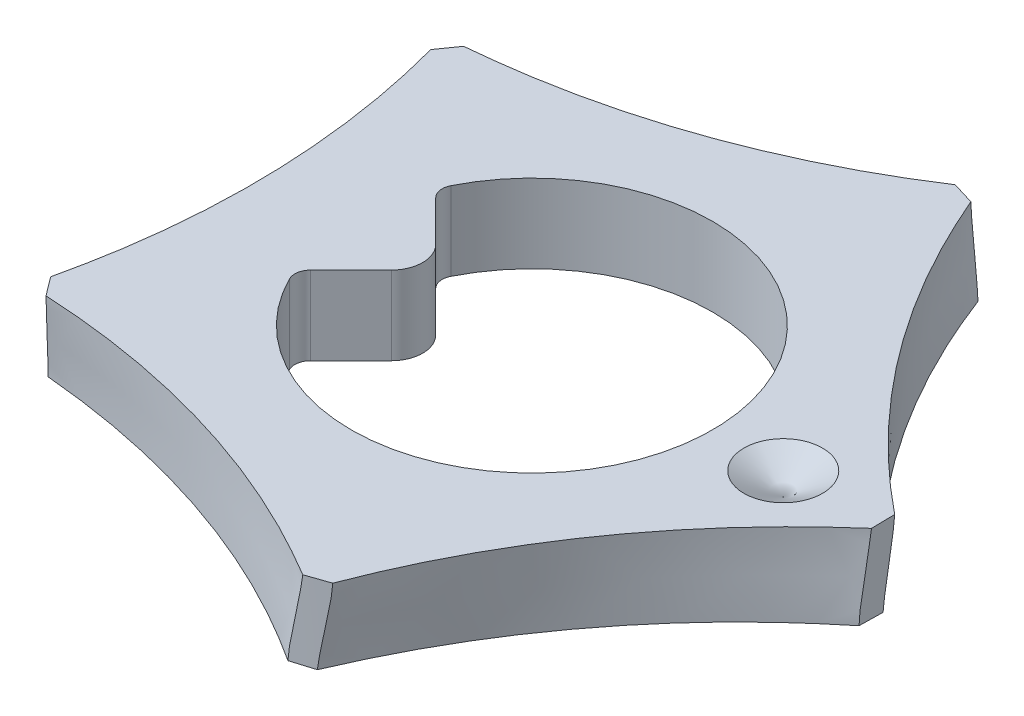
ISO-10303-21;
HEADER;
FILE_DESCRIPTION(('STEP AP214'),'2;1');
FILE_NAME('part.step','',(''),(''),'','','');
FILE_SCHEMA(('AUTOMOTIVE_DESIGN { 1 0 10303 214 1 1 1 1 }'));
ENDSEC;
DATA;
#1=APPLICATION_CONTEXT('core data for automotive mechanical design processes');
#2=APPLICATION_PROTOCOL_DEFINITION('international standard','automotive_design',2000,#1);
#3=PRODUCT_CONTEXT('',#1,'mechanical');
#4=PRODUCT('Part','Part','',(#3));
#5=PRODUCT_RELATED_PRODUCT_CATEGORY('part','',(#4));
#6=PRODUCT_DEFINITION_FORMATION('','',#4);
#7=PRODUCT_DEFINITION_CONTEXT('part definition',#1,'design');
#8=PRODUCT_DEFINITION('design','',#6,#7);
#9=PRODUCT_DEFINITION_SHAPE('','',#8);
#10=(LENGTH_UNIT() NAMED_UNIT(*) SI_UNIT(.MILLI.,.METRE.));
#11=(NAMED_UNIT(*) PLANE_ANGLE_UNIT() SI_UNIT($,.RADIAN.));
#12=(NAMED_UNIT(*) SI_UNIT($,.STERADIAN.) SOLID_ANGLE_UNIT());
#13=UNCERTAINTY_MEASURE_WITH_UNIT(LENGTH_MEASURE(1.E-05),#10,'distance_accuracy_value','');
#14=(GEOMETRIC_REPRESENTATION_CONTEXT(3) GLOBAL_UNCERTAINTY_ASSIGNED_CONTEXT((#13)) GLOBAL_UNIT_ASSIGNED_CONTEXT((#10,
#11,#12)) REPRESENTATION_CONTEXT('',''));
#15=CARTESIAN_POINT('',(0.,0.,0.));
#16=DIRECTION('',(0.,0.,1.));
#17=DIRECTION('',(1.,0.,0.));
#18=AXIS2_PLACEMENT_3D('',#15,#16,#17);
#19=CARTESIAN_POINT('',(2.18425107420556,0.55,-0.262768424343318));
#20=CARTESIAN_POINT('',(2.18417121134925,0.533281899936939,-0.263437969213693));
#21=CARTESIAN_POINT('',(2.18401055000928,0.499649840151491,-0.264784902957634));
#22=CARTESIAN_POINT('',(2.18522633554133,0.450042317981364,-0.254592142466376));
#23=CARTESIAN_POINT('',(2.18601881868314,0.399988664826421,-0.24766121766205));
#24=CARTESIAN_POINT('',(2.1868921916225,0.350003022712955,-0.23984216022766));
#25=CARTESIAN_POINT('',(2.18771020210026,0.299999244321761,-0.232256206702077));
#26=CARTESIAN_POINT('',(2.18850889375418,0.25,-0.224608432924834));
#27=CARTESIAN_POINT('',(2.18928028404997,0.200000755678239,-0.216957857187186));
#28=CARTESIAN_POINT('',(2.19002020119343,0.149996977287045,-0.209363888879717));
#29=CARTESIAN_POINT('',(2.19075325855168,0.10001133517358,-0.201530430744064));
#30=CARTESIAN_POINT('',(2.19138512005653,0.0499576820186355,-0.194583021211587));
#31=CARTESIAN_POINT('',(2.1922650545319,0.000350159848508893,-0.184355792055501));
#32=CARTESIAN_POINT('',(2.19214877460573,-0.0332818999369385,-0.185707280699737));
#33=CARTESIAN_POINT('',(2.19209097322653,-0.0500000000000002,-0.186379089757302));
#34=CARTESIAN_POINT('',(2.20000293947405,0.55,-0.112105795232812));
#35=CARTESIAN_POINT('',(2.19996925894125,0.533281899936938,-0.11278012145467));
#36=CARTESIAN_POINT('',(2.19990150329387,0.499649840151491,-0.114136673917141));
#37=CARTESIAN_POINT('',(2.20041423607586,0.450042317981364,-0.103871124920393));
#38=CARTESIAN_POINT('',(2.20072869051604,0.399988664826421,-0.096893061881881));
#39=CARTESIAN_POINT('',(2.20106280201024,0.350003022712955,-0.0890222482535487));
#40=CARTESIAN_POINT('',(2.20135765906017,0.299999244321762,-0.0813881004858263));
#41=CARTESIAN_POINT('',(2.20162896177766,0.25,-0.0736935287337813));
#42=CARTESIAN_POINT('',(2.20187279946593,0.200000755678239,-0.0659980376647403));
#43=CARTESIAN_POINT('',(2.20208909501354,0.149996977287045,-0.0583612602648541));
#44=CARTESIAN_POINT('',(2.20228204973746,0.10001133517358,-0.050485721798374));
#45=CARTESIAN_POINT('',(2.2024349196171,0.0499576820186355,-0.0435022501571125));
#46=CARTESIAN_POINT('',(2.20260978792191,0.000350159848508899,-0.0332253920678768));
#47=CARTESIAN_POINT('',(2.20258667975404,-0.0332818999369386,-0.034583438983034));
#48=CARTESIAN_POINT('',(2.20257519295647,-0.0500000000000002,-0.0352585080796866));
#49=CARTESIAN_POINT('',(2.20054832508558,0.55,0.0352614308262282));
#50=CARTESIAN_POINT('',(2.20055981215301,0.533281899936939,0.0345869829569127));
#51=CARTESIAN_POINT('',(2.20058292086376,0.499649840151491,0.0332301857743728));
#52=CARTESIAN_POINT('',(2.20040804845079,0.450042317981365,0.0434975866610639));
#53=CARTESIAN_POINT('',(2.20025520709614,0.39998866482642,0.0504746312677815));
#54=CARTESIAN_POINT('',(2.2000623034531,0.350003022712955,0.0583429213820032));
#55=CARTESIAN_POINT('',(2.19984608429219,0.299999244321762,0.0659726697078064));
#56=CARTESIAN_POINT('',(2.19960234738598,0.25,0.0736610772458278));
#57=CARTESIAN_POINT('',(2.19933117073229,0.200000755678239,0.0813485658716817));
#58=CARTESIAN_POINT('',(2.19903646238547,0.149996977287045,0.0889756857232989));
#59=CARTESIAN_POINT('',(2.1987025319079,0.10001133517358,0.0968392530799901));
#60=CARTESIAN_POINT('',(2.19838825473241,0.0499576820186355,0.103810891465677));
#61=CARTESIAN_POINT('',(2.19787582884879,0.000350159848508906,0.114066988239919));
#62=CARTESIAN_POINT('',(2.19794354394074,-0.0332818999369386,0.11271168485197));
#63=CARTESIAN_POINT('',(2.19797720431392,-0.0500000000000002,0.112037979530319));
#64=CARTESIAN_POINT('',(2.19209097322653,0.55,0.186379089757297));
#65=CARTESIAN_POINT('',(2.19214877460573,0.533281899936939,0.185707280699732));
#66=CARTESIAN_POINT('',(2.1922650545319,0.499649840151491,0.184355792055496));
#67=CARTESIAN_POINT('',(2.19138512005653,0.450042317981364,0.194583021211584));
#68=CARTESIAN_POINT('',(2.19075325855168,0.399988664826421,0.201530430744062));
#69=CARTESIAN_POINT('',(2.19002020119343,0.350003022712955,0.209363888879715));
#70=CARTESIAN_POINT('',(2.18928028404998,0.299999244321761,0.216957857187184));
#71=CARTESIAN_POINT('',(2.18850889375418,0.25,0.224608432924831));
#72=CARTESIAN_POINT('',(2.18771020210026,0.200000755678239,0.232256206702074));
#73=CARTESIAN_POINT('',(2.1868921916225,0.149996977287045,0.239842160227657));
#74=CARTESIAN_POINT('',(2.18601881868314,0.10001133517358,0.247661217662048));
#75=CARTESIAN_POINT('',(2.18522633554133,0.0499576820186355,0.254592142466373));
#76=CARTESIAN_POINT('',(2.18401055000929,0.000350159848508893,0.26478490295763));
#77=CARTESIAN_POINT('',(2.18417121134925,-0.0332818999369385,0.263437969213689));
#78=CARTESIAN_POINT('',(2.18425107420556,-0.0500000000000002,0.262768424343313));
#79=B_SPLINE_SURFACE_WITH_KNOTS('',3,3,((#19,#20,#21,#22,#23,#24,#25,#26,#27,#28,#29,#30,#31,
#32,#33),(#34,#35,#36,#37,#38,#39,#40,#41,#42,#43,#44,#45,#46,#47,#48),(#49,#50,#51,#52,#53,#54,
#55,#56,#57,#58,#59,#60,#61,#62,#63),(#64,#65,#66,#67,#68,#69,#70,#71,#72,#73,#74,#75,#76,#77,
#78)),.UNSPECIFIED.,.F.,.F.,.F.,(4,4),(4,1,1,1,1,1,1,1,1,1,1,1,4),(0.,1.),(0.,
0.0825276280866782,0.166022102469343,0.249516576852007,0.333011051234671,0.416505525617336,0.5,
0.583494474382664,0.666988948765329,0.750483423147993,0.833977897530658,0.917472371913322,1.),.UNSPECIFIED.);
#80=CARTESIAN_POINT('',(2.1947012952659,-1.09709078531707E-12,0.113184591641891));
#81=CARTESIAN_POINT('',(2.19589038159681,-5.48640022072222E-13,0.0882265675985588));
#82=CARTESIAN_POINT('',(2.19674027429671,-1.83007229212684E-13,0.06326160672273));
#83=CARTESIAN_POINT('',(2.19776167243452,1.82622415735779E-13,0.0133178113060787));
#84=CARTESIAN_POINT('',(2.19793317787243,1.82619267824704E-13,-0.0116610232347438));
#85=CARTESIAN_POINT('',(2.19776548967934,0.,-0.036646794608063));
#86=B_SPLINE_CURVE_WITH_KNOTS('',3,(#80,#81,#82,#83,#84,#85),.UNSPECIFIED.,.F.,.F.,(4,2,4),(0.,
0.0749382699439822,0.149876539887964),.UNSPECIFIED.);
#87=CARTESIAN_POINT('',(2.19585338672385,-2.32212708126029E-06,0.113238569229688));
#88=VERTEX_POINT('',#87);
#89=CARTESIAN_POINT('',(2.19878807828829,-3.90847496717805E-06,-0.036654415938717));
#90=VERTEX_POINT('',#89);
#91=EDGE_CURVE('E605',#88,#90,#86,.T.);
#92=CARTESIAN_POINT('',(2.19774997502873,-0.000108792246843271,-0.038636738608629));
#93=CARTESIAN_POINT('',(2.19771115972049,0.0209939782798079,-0.0397562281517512));
#94=CARTESIAN_POINT('',(2.19766199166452,0.0419810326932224,-0.041929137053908));
#95=CARTESIAN_POINT('',(2.19753959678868,0.0837732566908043,-0.047558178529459));
#96=CARTESIAN_POINT('',(2.19746638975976,0.104578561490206,-0.0510132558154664));
#97=CARTESIAN_POINT('',(2.19733598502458,0.135712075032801,-0.056543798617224));
#98=CARTESIAN_POINT('',(2.19728908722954,0.146076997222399,-0.0584451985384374));
#99=CARTESIAN_POINT('',(2.19718996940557,0.16680280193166,-0.0622675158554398));
#100=CARTESIAN_POINT('',(2.19713775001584,0.177163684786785,-0.0641884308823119));
#101=CARTESIAN_POINT('',(2.19703009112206,0.197903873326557,-0.0679466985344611));
#102=CARTESIAN_POINT('',(2.19697465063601,0.208283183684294,-0.0697840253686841));
#103=CARTESIAN_POINT('',(2.19689126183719,0.223874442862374,-0.0724127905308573));
#104=CARTESIAN_POINT('',(2.19686342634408,0.22907547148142,-0.0732678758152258));
#105=CARTESIAN_POINT('',(2.1968086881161,0.239489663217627,-0.0749016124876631));
#106=CARTESIAN_POINT('',(2.19678178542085,0.244702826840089,-0.0756802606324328));
#107=CARTESIAN_POINT('',(2.19672729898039,0.255129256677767,-0.0772327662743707));
#108=CARTESIAN_POINT('',(2.19669971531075,0.260342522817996,-0.0780066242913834));
#109=CARTESIAN_POINT('',(2.19664175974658,0.270757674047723,-0.0796265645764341));
#110=CARTESIAN_POINT('',(2.19661138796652,0.275959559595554,-0.0804726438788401));
#111=CARTESIAN_POINT('',(2.19651716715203,0.291554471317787,-0.0830689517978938));
#112=CARTESIAN_POINT('',(2.19645020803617,0.301937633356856,-0.0848773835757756));
#113=CARTESIAN_POINT('',(2.19630933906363,0.322686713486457,-0.088574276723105));
#114=CARTESIAN_POINT('',(2.19623543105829,0.333052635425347,-0.0904627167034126));
#115=CARTESIAN_POINT('',(2.19608202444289,0.353787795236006,-0.0942254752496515));
#116=CARTESIAN_POINT('',(2.19600252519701,0.364157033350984,-0.0960997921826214));
#117=CARTESIAN_POINT('',(2.19576645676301,0.395298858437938,-0.101561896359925));
#118=CARTESIAN_POINT('',(2.19561233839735,0.416102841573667,-0.104988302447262));
#119=CARTESIAN_POINT('',(2.19539271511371,0.447438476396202,-0.109245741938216));
#120=CARTESIAN_POINT('',(2.19532141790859,0.457907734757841,-0.110518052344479));
#121=CARTESIAN_POINT('',(2.19519848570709,0.478893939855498,-0.112659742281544));
#122=CARTESIAN_POINT('',(2.19514686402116,0.48941091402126,-0.113528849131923));
#123=CARTESIAN_POINT('',(2.19511304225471,0.499947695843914,-0.114141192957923));
#124=B_SPLINE_CURVE_WITH_KNOTS('',3,(#92,#93,#94,#95,#96,#97,#98,#99,#100,#101,#102,#103,#104,
#105,#106,#107,#108,#109,#110,#111,#112,#113,#114,#115,#116,#117,#118,#119,#120,#121,#122,#123),
.UNSPECIFIED.,.F.,.F.,(4,2,2,2,2,2,2,2,2,2,2,2,2,2,2,4),(0.,0.0632901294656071,
0.126528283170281,0.15814424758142,0.189756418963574,0.221378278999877,0.237190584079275,
0.253003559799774,0.268814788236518,0.284625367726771,0.316243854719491,0.347853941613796,
0.379467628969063,0.442703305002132,0.474335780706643,0.505989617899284),.UNSPECIFIED.);
#125=CARTESIAN_POINT('',(2.19608332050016,0.500004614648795,-0.113213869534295));
#126=VERTEX_POINT('',#125);
#127=EDGE_CURVE('E703',#90,#126,#124,.T.);
#128=CARTESIAN_POINT('',(2.1973121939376,0.5,0.0367087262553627));
#129=CARTESIAN_POINT('',(2.19763116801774,0.5,0.0117184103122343));
#130=CARTESIAN_POINT('',(2.19761081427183,0.5,-0.0132670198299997));
#131=CARTESIAN_POINT('',(2.1968914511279,0.5,-0.0632281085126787));
#132=CARTESIAN_POINT('',(2.19619244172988,0.5,-0.0882037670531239));
#133=CARTESIAN_POINT('',(2.19515410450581,0.5,-0.113174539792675));
#134=B_SPLINE_CURVE_WITH_KNOTS('',3,(#128,#129,#130,#131,#132,#133),.UNSPECIFIED.,.F.,.F.,(4,2,
4),(0.,0.0749563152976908,0.149912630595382),.UNSPECIFIED.);
#135=CARTESIAN_POINT('',(2.19863988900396,0.500008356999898,0.0367246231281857));
#136=VERTEX_POINT('',#135);
#137=EDGE_CURVE('E562',#136,#126,#134,.T.);
#138=CARTESIAN_POINT('',(2.19461932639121,9.01444299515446E-05,0.114924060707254));
#139=CARTESIAN_POINT('',(2.19464873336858,0.0106336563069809,0.114367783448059));
#140=CARTESIAN_POINT('',(2.19469584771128,0.0211573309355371,0.11353854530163));
#141=CARTESIAN_POINT('',(2.19481153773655,0.0421543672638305,0.111450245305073));
#142=CARTESIAN_POINT('',(2.19488009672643,0.0526277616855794,0.110191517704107));
#143=CARTESIAN_POINT('',(2.19509708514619,0.0839689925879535,0.105944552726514));
#144=CARTESIAN_POINT('',(2.19525689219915,0.104770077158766,0.102484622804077));
#145=CARTESIAN_POINT('',(2.19550103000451,0.135903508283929,0.0969573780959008));
#146=CARTESIAN_POINT('',(2.19558314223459,0.146269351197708,0.0950588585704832));
#147=CARTESIAN_POINT('',(2.19574203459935,0.166997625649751,0.0912477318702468));
#148=CARTESIAN_POINT('',(2.19581881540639,0.177360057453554,0.0893351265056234));
#149=CARTESIAN_POINT('',(2.19596468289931,0.198103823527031,0.0855961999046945));
#150=CARTESIAN_POINT('',(2.19603376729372,0.208485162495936,0.083769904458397));
#151=CARTESIAN_POINT('',(2.1961302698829,0.224079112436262,0.0811561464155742));
#152=CARTESIAN_POINT('',(2.19616125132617,0.229280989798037,0.08030580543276));
#153=CARTESIAN_POINT('',(2.19621994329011,0.239696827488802,0.0786815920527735));
#154=CARTESIAN_POINT('',(2.19624765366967,0.244910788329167,0.0779077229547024));
#155=CARTESIAN_POINT('',(2.19630229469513,0.255338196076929,0.0763593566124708));
#156=CARTESIAN_POINT('',(2.19632922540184,0.260551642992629,0.0755848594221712));
#157=CARTESIAN_POINT('',(2.19638431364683,0.270966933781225,0.0739623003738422));
#158=CARTESIAN_POINT('',(2.19641247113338,0.276168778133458,0.0731142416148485));
#159=CARTESIAN_POINT('',(2.19649707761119,0.291763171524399,0.0705098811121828));
#160=CARTESIAN_POINT('',(2.19655366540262,0.302145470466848,0.0686932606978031));
#161=CARTESIAN_POINT('',(2.19666408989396,0.322892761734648,0.0649797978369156));
#162=CARTESIAN_POINT('',(2.19671792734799,0.333257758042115,0.0630829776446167));
#163=CARTESIAN_POINT('',(2.19682017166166,0.353991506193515,0.0593074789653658));
#164=CARTESIAN_POINT('',(2.196868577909,0.36436025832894,0.0574288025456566));
#165=CARTESIAN_POINT('',(2.19700341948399,0.395503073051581,0.0519568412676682));
#166=CARTESIAN_POINT('',(2.19707946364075,0.416311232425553,0.0485281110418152));
#167=CARTESIAN_POINT('',(2.19720177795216,0.458097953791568,0.0428818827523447));
#168=CARTESIAN_POINT('',(2.19724802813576,0.479076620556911,0.0406651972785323));
#169=CARTESIAN_POINT('',(2.19727829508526,0.500166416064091,0.0394438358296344));
#170=B_SPLINE_CURVE_WITH_KNOTS('',3,(#138,#139,#140,#141,#142,#143,#144,#145,#146,#147,#148,
#149,#150,#151,#152,#153,#154,#155,#156,#157,#158,#159,#160,#161,#162,#163,#164,#165,#166,#167,
#168,#169),.UNSPECIFIED.,.F.,.F.,(4,2,2,2,2,2,2,2,2,2,2,2,2,2,2,4),(0.,0.0316634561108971,
0.063302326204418,0.126543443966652,0.15816032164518,0.189773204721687,0.221395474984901,
0.237208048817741,0.253021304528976,0.268833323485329,0.284644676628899,0.316264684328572,
0.347875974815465,0.379490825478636,0.442728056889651,0.506007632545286),.UNSPECIFIED.);
#171=EDGE_CURVE('E570',#88,#136,#170,.T.);
#172=ORIENTED_EDGE('',*,*,#91,.T.);
#173=ORIENTED_EDGE('',*,*,#127,.T.);
#174=ORIENTED_EDGE('',*,*,#137,.F.);
#175=ORIENTED_EDGE('',*,*,#171,.F.);
#176=EDGE_LOOP('',(#172,#173,#174,#175));
#177=FACE_BOUND('',#176,.T.);
#178=ADVANCED_FACE('F218',(#177),#79,.T.);
#179=CARTESIAN_POINT('',(0.468466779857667,-0.05,-3.58614599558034));
#180=CARTESIAN_POINT('',(0.480153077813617,-0.05,-3.43021993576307));
#181=CARTESIAN_POINT('',(0.50350309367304,-0.05,-3.11866909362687));
#182=CARTESIAN_POINT('',(0.594276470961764,-0.05,-2.65618471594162));
#183=CARTESIAN_POINT('',(0.702660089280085,-0.05,-2.2807827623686));
#184=CARTESIAN_POINT('',(0.837661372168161,-0.05,-1.91428839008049));
#185=CARTESIAN_POINT('',(0.998841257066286,-0.0500000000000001,-1.55629529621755));
#186=CARTESIAN_POINT('',(1.2309200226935,-0.0500000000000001,-1.14837472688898));
#187=CARTESIAN_POINT('',(1.49957907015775,-0.0500000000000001,-0.764527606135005));
#188=CARTESIAN_POINT('',(1.80510730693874,-0.0500000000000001,-0.405202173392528));
#189=CARTESIAN_POINT('',(2.08504771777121,-0.0500000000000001,-0.132710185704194));
#190=CARTESIAN_POINT('',(2.38316621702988,-0.0500000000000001,0.119501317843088));
#191=CARTESIAN_POINT('',(2.70028219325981,-0.0500000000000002,0.35070888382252));
#192=CARTESIAN_POINT('',(3.10220548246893,-0.0500000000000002,0.593173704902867));
#193=CARTESIAN_POINT('',(3.38746673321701,-0.0500000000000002,0.721936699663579));
#194=CARTESIAN_POINT('',(3.53010000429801,-0.0500000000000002,0.786319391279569));
#195=CARTESIAN_POINT('',(0.475260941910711,0.0514158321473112,-3.58526493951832));
#196=CARTESIAN_POINT('',(0.486240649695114,0.0513196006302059,-3.42938330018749));
#197=CARTESIAN_POINT('',(0.508178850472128,0.0511273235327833,-3.11792121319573));
#198=CARTESIAN_POINT('',(0.598844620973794,0.0509820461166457,-2.65513964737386));
#199=CARTESIAN_POINT('',(0.705840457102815,0.0507926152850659,-2.2798654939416));
#200=CARTESIAN_POINT('',(0.842055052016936,0.0504420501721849,-1.91238808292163));
#201=CARTESIAN_POINT('',(1.00017040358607,0.0507004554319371,-1.55533418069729));
#202=CARTESIAN_POINT('',(1.23307475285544,0.050271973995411,-1.14630972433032));
#203=CARTESIAN_POINT('',(1.50078652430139,0.0502716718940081,-0.761799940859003));
#204=CARTESIAN_POINT('',(1.80557023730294,0.0507007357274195,-0.40362453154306));
#205=CARTESIAN_POINT('',(2.08533903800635,0.0504418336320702,-0.127931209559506));
#206=CARTESIAN_POINT('',(2.38294658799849,0.0507922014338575,0.122804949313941));
#207=CARTESIAN_POINT('',(2.69970891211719,0.0509826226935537,0.355361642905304));
#208=CARTESIAN_POINT('',(3.10131640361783,0.0511269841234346,0.597823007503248));
#209=CARTESIAN_POINT('',(3.38618152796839,0.0513195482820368,0.727945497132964));
#210=CARTESIAN_POINT('',(3.52861673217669,0.051415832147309,0.793007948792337));
#211=CARTESIAN_POINT('',(0.430481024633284,0.150471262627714,-3.59096355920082));
#212=CARTESIAN_POINT('',(0.444182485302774,0.150472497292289,-3.43512552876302));
#213=CARTESIAN_POINT('',(0.471558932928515,0.150474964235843,-3.12375057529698));
#214=CARTESIAN_POINT('',(0.564979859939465,0.15014990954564,-2.66256271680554));
#215=CARTESIAN_POINT('',(0.677944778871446,0.150160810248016,-2.28831177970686));
#216=CARTESIAN_POINT('',(0.816978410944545,0.150127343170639,-1.92321150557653));
#217=CARTESIAN_POINT('',(0.981551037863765,0.150060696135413,-1.56739334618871));
#218=CARTESIAN_POINT('',(1.21844535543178,0.150074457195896,-1.1617464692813));
#219=CARTESIAN_POINT('',(1.49119516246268,0.150074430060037,-0.780791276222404));
#220=CARTESIAN_POINT('',(1.80063706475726,0.150060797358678,-0.425255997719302));
#221=CARTESIAN_POINT('',(2.08352528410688,0.150127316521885,-0.155178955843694));
#222=CARTESIAN_POINT('',(2.38434515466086,0.150160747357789,0.0936942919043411));
#223=CARTESIAN_POINT('',(2.70403642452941,0.150150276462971,0.320950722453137));
#224=CARTESIAN_POINT('',(3.10822918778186,0.150474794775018,0.561399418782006));
#225=CARTESIAN_POINT('',(3.39493125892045,0.150472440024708,0.686408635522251));
#226=CARTESIAN_POINT('',(3.53828495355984,0.150471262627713,0.748914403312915));
#227=CARTESIAN_POINT('',(0.380882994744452,0.34949724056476,-3.59660452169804));
#228=CARTESIAN_POINT('',(0.395957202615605,0.349494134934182,-3.441059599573));
#229=CARTESIAN_POINT('',(0.42607649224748,0.349487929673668,-3.13027029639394));
#230=CARTESIAN_POINT('',(0.531318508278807,0.349913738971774,-2.66963746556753));
#231=CARTESIAN_POINT('',(0.647913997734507,0.349868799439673,-2.29698088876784));
#232=CARTESIAN_POINT('',(0.791460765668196,0.34988812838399,-1.93394870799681));
#233=CARTESIAN_POINT('',(0.962280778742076,0.349992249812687,-1.57925770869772));
#234=CARTESIAN_POINT('',(1.20280421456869,0.349914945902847,-1.17771508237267));
#235=CARTESIAN_POINT('',(1.4808576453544,0.349914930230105,-0.800593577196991));
#236=CARTESIAN_POINT('',(1.79521826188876,0.349992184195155,-0.44724487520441));
#237=CARTESIAN_POINT('',(2.08130046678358,0.349888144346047,-0.182772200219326));
#238=CARTESIAN_POINT('',(2.38544777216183,0.349868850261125,0.0624632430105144));
#239=CARTESIAN_POINT('',(2.70787100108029,0.349913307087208,0.286751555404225));
#240=CARTESIAN_POINT('',(3.11599301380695,0.349488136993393,0.516124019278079));
#241=CARTESIAN_POINT('',(3.40421275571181,0.349494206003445,0.638718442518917));
#242=CARTESIAN_POINT('',(3.54832529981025,0.349497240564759,0.70001679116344));
#243=CARTESIAN_POINT('',(0.338325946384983,0.448059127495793,-3.60076752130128));
#244=CARTESIAN_POINT('',(0.354560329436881,0.448605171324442,-3.4455111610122));
#245=CARTESIAN_POINT('',(0.386997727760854,0.44969620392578,-3.13529842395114));
#246=CARTESIAN_POINT('',(0.499816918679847,0.447714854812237,-2.67562856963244));
#247=CARTESIAN_POINT('',(0.619386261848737,0.449154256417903,-2.30475633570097));
#248=CARTESIAN_POINT('',(0.767759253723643,0.449283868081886,-1.94343501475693));
#249=CARTESIAN_POINT('',(0.942736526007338,0.448981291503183,-1.59088646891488));
#250=CARTESIAN_POINT('',(1.18783740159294,0.449791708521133,-1.19267447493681));
#251=CARTESIAN_POINT('',(1.47064434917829,0.449792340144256,-0.819129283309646));
#252=CARTESIAN_POINT('',(1.78955763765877,0.448980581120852,-0.469282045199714));
#253=CARTESIAN_POINT('',(2.0788307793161,0.449283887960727,-0.208177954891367));
#254=CARTESIAN_POINT('',(2.38598349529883,0.449154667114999,0.0329041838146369));
#255=CARTESIAN_POINT('',(2.71097269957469,0.447714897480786,0.254822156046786));
#256=CARTESIAN_POINT('',(3.12213208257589,0.4496966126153,0.477211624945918));
#257=CARTESIAN_POINT('',(3.41155279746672,0.448604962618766,0.597736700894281));
#258=CARTESIAN_POINT('',(3.55626583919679,0.448059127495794,0.658000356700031));
#259=CARTESIAN_POINT('',(0.343026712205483,0.55,-3.60031066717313));
#260=CARTESIAN_POINT('',(0.360147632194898,0.55,-3.44488743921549));
#261=CARTESIAN_POINT('',(0.394356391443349,0.55,-3.13434128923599));
#262=CARTESIAN_POINT('',(0.501214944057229,0.55,-2.67530658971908));
#263=CARTESIAN_POINT('',(0.622633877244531,0.55,-2.30391585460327));
#264=CARTESIAN_POINT('',(0.770343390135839,0.55,-1.94235621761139));
#265=CARTESIAN_POINT('',(0.943918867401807,0.55,-1.59020630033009));
#266=CARTESIAN_POINT('',(1.19009247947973,0.55,-1.19063365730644));
#267=CARTESIAN_POINT('',(1.47198393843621,0.55,-0.816396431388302));
#268=CARTESIAN_POINT('',(1.78986633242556,0.55,-0.467952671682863));
#269=CARTESIAN_POINT('',(2.07914604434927,0.55,-0.205396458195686));
#270=CARTESIAN_POINT('',(2.38588499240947,0.55,0.0362572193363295));
#271=CARTESIAN_POINT('',(2.71087681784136,0.55,0.256256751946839));
#272=CARTESIAN_POINT('',(3.12101716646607,0.55,0.484546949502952));
#273=CARTESIAN_POINT('',(3.41059840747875,0.55,0.603276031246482));
#274=CARTESIAN_POINT('',(3.55539171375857,0.55,0.662641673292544));
#275=B_SPLINE_SURFACE_WITH_KNOTS('',3,3,((#179,#180,#181,#182,#183,#184,#185,#186,#187,#188,
#189,#190,#191,#192,#193,#194),(#195,#196,#197,#198,#199,#200,#201,#202,#203,#204,#205,#206,
#207,#208,#209,#210),(#211,#212,#213,#214,#215,#216,#217,#218,#219,#220,#221,#222,#223,#224,
#225,#226),(#227,#228,#229,#230,#231,#232,#233,#234,#235,#236,#237,#238,#239,#240,#241,#242),
(#243,#244,#245,#246,#247,#248,#249,#250,#251,#252,#253,#254,#255,#256,#257,#258),(#259,#260,
#261,#262,#263,#264,#265,#266,#267,#268,#269,#270,#271,#272,#273,#274)),.UNSPECIFIED.,.F.,.F.,
.F.,(4,2,4),(4,1,1,1,1,1,1,1,1,1,1,1,1,4),(0.,0.5,1.),(0.,0.0834082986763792,0.166655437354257,
0.250063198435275,0.291767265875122,0.374969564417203,0.458332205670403,0.541740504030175,
0.624885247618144,0.708268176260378,0.74998380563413,0.833223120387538,0.9166100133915,1.),.UNSPECIFIED.);
#276=CARTESIAN_POINT('',(2.19615686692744,0.500000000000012,-0.113305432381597));
#277=CARTESIAN_POINT('',(2.13254526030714,0.500000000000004,-0.164399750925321));
#278=CARTESIAN_POINT('',(2.07017327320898,0.500000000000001,-0.217021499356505));
#279=CARTESIAN_POINT('',(1.9480925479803,0.499999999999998,-0.32524351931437));
#280=CARTESIAN_POINT('',(1.88838327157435,0.499999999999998,-0.380843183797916));
#281=CARTESIAN_POINT('',(1.71490349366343,0.499999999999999,-0.550640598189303));
#282=CARTESIAN_POINT('',(1.60522868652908,0.499999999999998,-0.669081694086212));
#283=CARTESIAN_POINT('',(1.42097738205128,0.499999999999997,-0.888115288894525));
#284=CARTESIAN_POINT('',(1.34404717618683,0.499999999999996,-0.986749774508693));
#285=CARTESIAN_POINT('',(1.19784387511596,0.499999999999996,-1.18959227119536));
#286=CARTESIAN_POINT('',(1.12857262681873,0.499999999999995,-1.29380161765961));
#287=CARTESIAN_POINT('',(0.996830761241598,0.499999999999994,-1.50913485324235));
#288=CARTESIAN_POINT('',(0.934511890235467,0.499999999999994,-1.62035171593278));
#289=CARTESIAN_POINT('',(0.847454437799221,0.499999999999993,-1.7904243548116));
#290=CARTESIAN_POINT('',(0.819504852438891,0.499999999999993,-1.84765783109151));
#291=CARTESIAN_POINT('',(0.765804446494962,0.499999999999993,-1.96314633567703));
#292=CARTESIAN_POINT('',(0.740053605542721,0.499999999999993,-2.02140135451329));
#293=CARTESIAN_POINT('',(0.715430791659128,0.499999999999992,-2.08013761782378));
#294=B_SPLINE_CURVE_WITH_KNOTS('',3,(#276,#277,#278,#279,#280,#281,#282,#283,#284,#285,#286,
#287,#288,#289,#290,#291,#292,#293),.UNSPECIFIED.,.F.,.F.,(4,2,2,2,2,2,2,2,4),(0.,
0.244727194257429,0.48940468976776,0.972816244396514,1.34776264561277,1.72279926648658,
2.10486308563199,2.29590390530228,2.48694295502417),.UNSPECIFIED.);
#295=CARTESIAN_POINT('',(0.714344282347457,0.500008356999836,-2.07968226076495));
#296=VERTEX_POINT('',#295);
#297=EDGE_CURVE('E559',#126,#296,#294,.T.);
#298=CARTESIAN_POINT('',(2.1993291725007,0.,-0.0372835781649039));
#299=CARTESIAN_POINT('',(2.13846217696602,0.,-0.0896186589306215));
#300=CARTESIAN_POINT('',(2.07891770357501,0.,-0.143480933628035));
#301=CARTESIAN_POINT('',(1.9625328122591,0.,-0.254036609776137));
#302=CARTESIAN_POINT('',(1.905692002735,0.,-0.310729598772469));
#303=CARTESIAN_POINT('',(1.79540919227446,0.,-0.426055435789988));
#304=CARTESIAN_POINT('',(1.74193503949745,0.,-0.484657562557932));
#305=CARTESIAN_POINT('',(1.63777692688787,0.,-0.60430454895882));
#306=CARTESIAN_POINT('',(1.58709338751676,0.,-0.66534977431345));
#307=CARTESIAN_POINT('',(1.45961236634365,0.,-0.826657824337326));
#308=CARTESIAN_POINT('',(1.38511214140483,0.,-0.928749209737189));
#309=CARTESIAN_POINT('',(1.24399456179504,0.,-1.13826350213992));
#310=CARTESIAN_POINT('',(1.17737836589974,0.,-1.24568718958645));
#311=CARTESIAN_POINT('',(1.08309983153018,0.,-1.41140375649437));
#312=CARTESIAN_POINT('',(1.05235307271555,0.,-1.46796035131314));
#313=CARTESIAN_POINT('',(0.993140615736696,0.,-1.58223770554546));
#314=CARTESIAN_POINT('',(0.964674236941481,0.,-1.6399581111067));
#315=CARTESIAN_POINT('',(0.91000608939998,0.,-1.75644559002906));
#316=CARTESIAN_POINT('',(0.883803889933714,0.,-1.81521246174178));
#317=CARTESIAN_POINT('',(0.833620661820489,0.,-1.93370775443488));
#318=CARTESIAN_POINT('',(0.809640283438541,0.,-1.9934364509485));
#319=CARTESIAN_POINT('',(0.786759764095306,0.,-2.05358095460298));
#320=B_SPLINE_CURVE_WITH_KNOTS('',3,(#298,#299,#300,#301,#302,#303,#304,#305,#306,#307,#308,
#309,#310,#311,#312,#313,#314,#315,#316,#317,#318,#319),.UNSPECIFIED.,.F.,.F.,(4,2,2,2,2,2,2,2,
2,2,4),(0.,0.24078289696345,0.481530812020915,0.719442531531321,0.957389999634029,
1.336159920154,1.71498544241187,1.90806539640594,2.10108750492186,2.29407281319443,
2.48711442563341),.UNSPECIFIED.);
#321=CARTESIAN_POINT('',(0.78625229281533,-2.32212684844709E-06,-2.05338802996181));
#322=VERTEX_POINT('',#321);
#323=EDGE_CURVE('E519',#90,#322,#320,.T.);
#324=CARTESIAN_POINT('',(0.787473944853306,9.01444301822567E-05,-2.05169352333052));
#325=CARTESIAN_POINT('',(0.786953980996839,0.0106336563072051,-2.05189339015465));
#326=CARTESIAN_POINT('',(0.786179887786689,0.0211573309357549,-2.05219444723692));
#327=CARTESIAN_POINT('',(0.78422954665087,0.0421543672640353,-2.05294979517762));
#328=CARTESIAN_POINT('',(0.783053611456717,0.0526277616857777,-2.05340396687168));
#329=CARTESIAN_POINT('',(0.779081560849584,0.0839689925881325,-2.05492271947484));
#330=CARTESIAN_POINT('',(0.775840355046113,0.104770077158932,-2.0561438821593));
#331=CARTESIAN_POINT('',(0.77065907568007,0.135903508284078,-2.05808408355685));
#332=CARTESIAN_POINT('',(0.768878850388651,0.14626935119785,-2.05874885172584));
#333=CARTESIAN_POINT('',(0.765303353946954,0.166997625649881,-2.06007767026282));
#334=CARTESIAN_POINT('',(0.763508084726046,0.177360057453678,-2.06074172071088));
#335=CARTESIAN_POINT('',(0.759997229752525,0.198103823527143,-2.06203584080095));
#336=CARTESIAN_POINT('',(0.758281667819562,0.208485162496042,-2.06266590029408));
#337=CARTESIAN_POINT('',(0.755825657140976,0.224079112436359,-2.06356537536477));
#338=CARTESIAN_POINT('',(0.755026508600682,0.229280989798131,-2.06385761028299));
#339=CARTESIAN_POINT('',(0.753499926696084,0.23969682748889,-2.06441533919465));
#340=CARTESIAN_POINT('',(0.752772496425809,0.244910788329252,-2.06468083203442));
#341=CARTESIAN_POINT('',(0.751316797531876,0.255338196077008,-2.06521127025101));
#342=CARTESIAN_POINT('',(0.750588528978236,0.260551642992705,-2.06547621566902));
#343=CARTESIAN_POINT('',(0.749062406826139,0.270966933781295,-2.06603000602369));
#344=CARTESIAN_POINT('',(0.748264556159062,0.276168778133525,-2.06631884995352));
#345=CARTESIAN_POINT('',(0.745813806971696,0.291763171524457,-2.06720410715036));
#346=CARTESIAN_POINT('',(0.744103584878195,0.302145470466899,-2.06781929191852));
#347=CARTESIAN_POINT('',(0.740605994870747,0.322892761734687,-2.06907183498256));
#348=CARTESIAN_POINT('',(0.738818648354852,0.333257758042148,-2.06970918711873));
#349=CARTESIAN_POINT('',(0.735259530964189,0.353991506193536,-2.07097312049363));
#350=CARTESIAN_POINT('',(0.733487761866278,0.364360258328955,-2.07159970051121));
#351=CARTESIAN_POINT('',(0.728325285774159,0.395503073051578,-2.07341887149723));
#352=CARTESIAN_POINT('',(0.725087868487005,0.416311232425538,-2.07455072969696));
#353=CARTESIAN_POINT('',(0.719755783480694,0.458097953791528,-2.07641183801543));
#354=CARTESIAN_POINT('',(0.717661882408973,0.479076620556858,-2.07714081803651));
#355=CARTESIAN_POINT('',(0.716509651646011,0.500166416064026,-2.07754702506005));
#356=B_SPLINE_CURVE_WITH_KNOTS('',3,(#324,#325,#326,#327,#328,#329,#330,#331,#332,#333,#334,
#335,#336,#337,#338,#339,#340,#341,#342,#343,#344,#345,#346,#347,#348,#349,#350,#351,#352,#353,
#354,#355),.UNSPECIFIED.,.F.,.F.,(4,2,2,2,2,2,2,2,2,2,2,2,2,2,2,4),(0.,0.0316634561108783,
0.0633023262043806,0.126543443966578,0.158160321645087,0.189773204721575,0.221395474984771,
0.237208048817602,0.253021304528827,0.268833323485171,0.284644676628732,0.316264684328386,
0.347875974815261,0.379490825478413,0.442728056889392,0.50600763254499),.UNSPECIFIED.);
#357=EDGE_CURVE('E676',#322,#296,#356,.T.);
#358=ORIENTED_EDGE('',*,*,#297,.F.);
#359=ORIENTED_EDGE('',*,*,#127,.F.);
#360=ORIENTED_EDGE('',*,*,#323,.T.);
#361=ORIENTED_EDGE('',*,*,#357,.T.);
#362=EDGE_LOOP('',(#358,#359,#360,#361));
#363=FACE_BOUND('',#362,.T.);
#364=ADVANCED_FACE('F526',(#363),#275,.T.);
#365=CARTESIAN_POINT('',(0.425063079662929,0.55,-2.1585461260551));
#366=CARTESIAN_POINT('',(0.424401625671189,0.533281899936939,-2.15867707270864));
#367=CARTESIAN_POINT('',(0.423070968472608,0.499649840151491,-2.15894050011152));
#368=CARTESIAN_POINT('',(0.433140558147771,0.450042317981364,-2.1569470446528));
#369=CARTESIAN_POINT('',(0.439977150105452,0.39998866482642,-2.1555589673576));
#370=CARTESIAN_POINT('',(0.447683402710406,0.350003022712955,-2.15397337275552));
#371=CARTESIAN_POINT('',(0.455150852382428,0.299999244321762,-2.15240715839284));
#372=CARTESIAN_POINT('',(0.462671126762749,0.25,-2.15080346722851));
#373=CARTESIAN_POINT('',(0.470185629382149,0.200000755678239,-2.14917294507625));
#374=CARTESIAN_POINT('',(0.477636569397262,0.149996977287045,-2.14752998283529));
#375=CARTESIAN_POINT('',(0.48531315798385,0.10001133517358,-2.14580649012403));
#376=CARTESIAN_POINT('',(0.492115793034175,0.0499576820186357,-2.1442605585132));
#377=CARTESIAN_POINT('',(0.502114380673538,0.000350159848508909,-2.14193703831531));
#378=CARTESIAN_POINT('',(0.500793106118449,-0.0332818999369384,-2.14224408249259));
#379=CARTESIAN_POINT('',(0.500136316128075,-0.0500000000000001,-2.14239671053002));
#380=CARTESIAN_POINT('',(0.573219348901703,0.550000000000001,-2.12696972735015));
#381=CARTESIAN_POINT('',(0.572567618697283,0.533281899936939,-2.12714607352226));
#382=CARTESIAN_POINT('',(0.571256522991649,0.499649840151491,-2.12750083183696));
#383=CARTESIAN_POINT('',(0.581178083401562,0.450042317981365,-2.12481624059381));
#384=CARTESIAN_POINT('',(0.587911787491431,0.39998866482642,-2.12295896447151));
#385=CARTESIAN_POINT('',(0.595500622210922,0.350003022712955,-2.12084450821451));
#386=CARTESIAN_POINT('',(0.602852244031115,0.299999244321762,-2.11876585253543));
#387=CARTESIAN_POINT('',(0.610254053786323,0.25,-2.11664612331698));
#388=CARTESIAN_POINT('',(0.617648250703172,0.200000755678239,-2.11449998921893));
#389=CARTESIAN_POINT('',(0.624978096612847,0.149996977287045,-2.11234580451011));
#390=CARTESIAN_POINT('',(0.632527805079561,0.10001133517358,-2.11009564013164));
#391=CARTESIAN_POINT('',(0.639216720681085,0.0499576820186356,-2.10808301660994));
#392=CARTESIAN_POINT('',(0.649044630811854,0.000350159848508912,-2.10507360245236));
#393=CARTESIAN_POINT('',(0.647745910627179,-0.0332818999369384,-2.10547128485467));
#394=CARTESIAN_POINT('',(0.647100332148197,-0.0500000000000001,-2.10566896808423));
#395=CARTESIAN_POINT('',(0.713542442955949,0.55,-2.08194944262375));
#396=CARTESIAN_POINT('',(0.712904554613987,0.533281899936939,-2.08216878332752));
#397=CARTESIAN_POINT('',(0.711621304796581,0.499649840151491,-2.08261003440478));
#398=CARTESIAN_POINT('',(0.721332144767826,0.450042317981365,-2.07927091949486));
#399=CARTESIAN_POINT('',(0.7279204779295,0.39998866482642,-2.07696953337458));
#400=CARTESIAN_POINT('',(0.735344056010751,0.350003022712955,-2.07435463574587));
#401=CARTESIAN_POINT('',(0.74253356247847,0.299999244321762,-2.07179127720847));
#402=CARTESIAN_POINT('',(0.749770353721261,0.25,-2.06918362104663));
#403=CARTESIAN_POINT('',(0.756997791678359,0.200000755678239,-2.06655015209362));
#404=CARTESIAN_POINT('',(0.764160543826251,0.149996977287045,-2.06391295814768));
#405=CARTESIAN_POINT('',(0.77153605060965,0.10001133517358,-2.06116539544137));
#406=CARTESIAN_POINT('',(0.778069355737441,0.0499576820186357,-2.05871214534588));
#407=CARTESIAN_POINT('',(0.787665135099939,0.000350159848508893,-2.05505549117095));
#408=CARTESIAN_POINT('',(0.786397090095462,-0.0332818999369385,-2.05553870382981));
#409=CARTESIAN_POINT('',(0.785766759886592,-0.0500000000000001,-2.05577890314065));
#410=CARTESIAN_POINT('',(0.854650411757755,0.55,-2.02720809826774));
#411=CARTESIAN_POINT('',(0.854029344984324,0.533281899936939,-2.02747067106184));
#412=CARTESIAN_POINT('',(0.852779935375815,0.499649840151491,-2.0279988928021));
#413=CARTESIAN_POINT('',(0.862234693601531,0.450042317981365,-2.0240016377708));
#414=CARTESIAN_POINT('',(0.868646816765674,0.39998866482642,-2.02125383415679));
#415=CARTESIAN_POINT('',(0.875870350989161,0.350003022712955,-2.01813598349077));
#416=CARTESIAN_POINT('',(0.882863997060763,0.299999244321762,-2.01508561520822));
#417=CARTESIAN_POINT('',(0.889901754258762,0.25,-2.01198782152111));
#418=CARTESIAN_POINT('',(0.896928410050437,0.200000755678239,-2.00886492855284));
#419=CARTESIAN_POINT('',(0.90389030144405,0.149996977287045,-2.00574276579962));
#420=CARTESIAN_POINT('',(0.911056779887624,0.10001133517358,-2.00249591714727));
#421=CARTESIAN_POINT('',(0.917403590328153,0.0499576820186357,-1.99960044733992));
#422=CARTESIAN_POINT('',(0.926721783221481,0.000350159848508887,-1.99529443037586));
#423=CARTESIAN_POINT('',(0.925490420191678,-0.0332818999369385,-1.99586345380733));
#424=CARTESIAN_POINT('',(0.924878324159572,-0.0500000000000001,-1.99614630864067));
#425=B_SPLINE_SURFACE_WITH_KNOTS('',3,3,((#365,#366,#367,#368,#369,#370,#371,#372,#373,#374,
#375,#376,#377,#378,#379),(#380,#381,#382,#383,#384,#385,#386,#387,#388,#389,#390,#391,#392,
#393,#394),(#395,#396,#397,#398,#399,#400,#401,#402,#403,#404,#405,#406,#407,#408,#409),(#410,
#411,#412,#413,#414,#415,#416,#417,#418,#419,#420,#421,#422,#423,#424)),.UNSPECIFIED.,.F.,.F.,
.F.,(4,4),(4,1,1,1,1,1,1,1,1,1,1,1,4),(0.,1.),(0.,0.0825276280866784,0.166022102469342,
0.249516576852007,0.333011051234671,0.416505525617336,0.5,0.583494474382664,0.666988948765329,
0.750483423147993,0.833977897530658,0.917472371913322,1.),.UNSPECIFIED.);
#426=CARTESIAN_POINT('',(0.78584494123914,-1.09697668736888E-12,-2.0523090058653));
#427=CARTESIAN_POINT('',(0.7624758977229,-5.4854925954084E-13,-2.06115234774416));
#428=CARTESIAN_POINT('',(0.738995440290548,-1.82938177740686E-13,-2.06967524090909));
#429=CARTESIAN_POINT('',(0.691811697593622,1.82651293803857E-13,-2.08608012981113));
#430=CARTESIAN_POINT('',(0.668108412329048,1.82629683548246E-13,-2.09396212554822));
#431=CARTESIAN_POINT('',(0.644293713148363,0.,-2.1015236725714));
#432=B_SPLINE_CURVE_WITH_KNOTS('',3,(#426,#427,#428,#429,#430,#431),.UNSPECIFIED.,.F.,.F.,(4,2,
4),(0.,0.0749382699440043,0.149876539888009),.UNSPECIFIED.);
#433=CARTESIAN_POINT('',(0.644602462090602,-3.9084749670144E-06,-2.10249856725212));
#434=VERTEX_POINT('',#433);
#435=EDGE_CURVE('E518',#322,#434,#432,.T.);
#436=CARTESIAN_POINT('',(0.642396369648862,-0.000108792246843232,-2.10212384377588));
#437=CARTESIAN_POINT('',(0.641319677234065,0.020993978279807,-2.10243286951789));
#438=CARTESIAN_POINT('',(0.639237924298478,0.0419810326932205,-2.10305757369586));
#439=CARTESIAN_POINT('',(0.633846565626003,0.0837732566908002,-2.10468063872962));
#440=CARTESIAN_POINT('',(0.630537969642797,0.104578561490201,-2.10567869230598));
#441=CARTESIAN_POINT('',(0.625237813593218,0.135712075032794,-2.10726370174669));
#442=CARTESIAN_POINT('',(0.623414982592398,0.146076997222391,-2.10780666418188));
#443=CARTESIAN_POINT('',(0.619749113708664,0.166802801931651,-2.10889355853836));
#444=CARTESIAN_POINT('',(0.617906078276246,0.177163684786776,-2.10943749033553));
#445=CARTESIAN_POINT('',(0.614298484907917,0.197903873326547,-2.11049646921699));
#446=CARTESIAN_POINT('',(0.6125339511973,0.208283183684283,-2.11101150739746));
#447=CARTESIAN_POINT('',(0.610008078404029,0.223874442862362,-2.11174453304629));
#448=CARTESIAN_POINT('',(0.609186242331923,0.229075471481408,-2.11198229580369));
#449=CARTESIAN_POINT('',(0.607615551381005,0.239489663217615,-2.1124350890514));
#450=CARTESIAN_POINT('',(0.606866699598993,0.244702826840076,-2.11265011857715));
#451=CARTESIAN_POINT('',(0.605373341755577,0.255129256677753,-2.11307804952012));
#452=CARTESIAN_POINT('',(0.604628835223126,0.260342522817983,-2.11329095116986));
#453=CARTESIAN_POINT('',(0.60307027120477,0.270757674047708,-2.11373642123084));
#454=CARTESIAN_POINT('',(0.602256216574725,0.27595955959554,-2.11396898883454));
#455=CARTESIAN_POINT('',(0.599757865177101,0.291554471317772,-2.11468168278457));
#456=CARTESIAN_POINT('',(0.598017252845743,0.30193763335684,-2.11517683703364));
#457=CARTESIAN_POINT('',(0.594457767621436,0.322686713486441,-2.11618526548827));
#458=CARTESIAN_POINT('',(0.59263891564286,0.333052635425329,-2.11669853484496));
#459=CARTESIAN_POINT('',(0.589012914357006,0.353787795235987,-2.11771539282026));
#460=CARTESIAN_POINT('',(0.587205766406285,0.364157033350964,-2.11821898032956));
#461=CARTESIAN_POINT('',(0.581938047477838,0.395298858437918,-2.11968234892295));
#462=CARTESIAN_POINT('',(0.578631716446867,0.416102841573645,-2.12059459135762));
#463=CARTESIAN_POINT('',(0.574514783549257,0.447438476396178,-2.12170133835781));
#464=CARTESIAN_POINT('',(0.573282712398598,0.457907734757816,-2.12202669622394));
#465=CARTESIAN_POINT('',(0.571207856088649,0.478893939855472,-2.12257159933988));
#466=CARTESIAN_POINT('',(0.570365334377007,0.489410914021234,-2.12279107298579));
#467=CARTESIAN_POINT('',(0.569772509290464,0.499947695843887,-2.12294813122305));
#468=B_SPLINE_CURVE_WITH_KNOTS('',3,(#436,#437,#438,#439,#440,#441,#442,#443,#444,#445,#446,
#447,#448,#449,#450,#451,#452,#453,#454,#455,#456,#457,#458,#459,#460,#461,#462,#463,#464,#465,
#466,#467),.UNSPECIFIED.,.F.,.F.,(4,2,2,2,2,2,2,2,2,2,2,2,2,2,2,4),(0.,0.0632901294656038,
0.126528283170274,0.158144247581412,0.189756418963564,0.221378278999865,0.237190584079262,
0.253003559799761,0.268814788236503,0.284625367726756,0.316243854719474,0.347853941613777,
0.379467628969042,0.442703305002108,0.474335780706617,0.505989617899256),.UNSPECIFIED.);
#469=CARTESIAN_POINT('',(0.570954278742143,0.500004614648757,-2.12358436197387));
#470=VERTEX_POINT('',#469);
#471=EDGE_CURVE('E677',#434,#470,#468,.T.);
#472=CARTESIAN_POINT('',(0.713918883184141,0.499999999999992,-2.07842446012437));
#473=CARTESIAN_POINT('',(0.690250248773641,0.499999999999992,-2.08645025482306));
#474=CARTESIAN_POINT('',(0.666481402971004,0.499999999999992,-2.09415181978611));
#475=CARTESIAN_POINT('',(0.618743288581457,0.499999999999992,-2.10890649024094));
#476=CARTESIAN_POINT('',(0.594774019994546,0.499999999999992,-2.11595959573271));
#477=CARTESIAN_POINT('',(0.570704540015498,0.499999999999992,-2.12268847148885));
#478=B_SPLINE_CURVE_WITH_KNOTS('',3,(#472,#473,#474,#475,#476,#477),.UNSPECIFIED.,.F.,.F.,(4,2,
4),(0.,0.0749563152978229,0.149912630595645),.UNSPECIFIED.);
#479=EDGE_CURVE('E557',#296,#470,#478,.T.);
#480=ORIENTED_EDGE('',*,*,#357,.F.);
#481=ORIENTED_EDGE('',*,*,#435,.T.);
#482=ORIENTED_EDGE('',*,*,#471,.T.);
#483=ORIENTED_EDGE('',*,*,#479,.F.);
#484=EDGE_LOOP('',(#480,#481,#482,#483));
#485=FACE_BOUND('',#484,.T.);
#486=ADVANCED_FACE('F520',(#485),#425,.T.);
#487=CARTESIAN_POINT('',(-3.26586332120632,-0.0499999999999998,-1.55371844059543));
#488=CARTESIAN_POINT('',(-3.11395756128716,-0.0499999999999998,-1.51664896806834));
#489=CARTESIAN_POINT('',(-2.8104395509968,-0.0499999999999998,-1.44258164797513));
#490=CARTESIAN_POINT('',(-2.34254025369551,-0.0499999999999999,-1.38599672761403));
#491=CARTESIAN_POINT('',(-1.95201939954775,-0.0499999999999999,-1.37307009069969));
#492=CARTESIAN_POINT('',(-1.5617448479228,-0.0499999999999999,-1.3882109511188));
#493=CARTESIAN_POINT('',(-1.17146585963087,-0.0499999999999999,-1.43087618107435));
#494=CARTESIAN_POINT('',(-0.711794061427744,-0.05,-1.52554181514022));
#495=CARTESIAN_POINT('',(-0.263713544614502,-0.05,-1.66243646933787));
#496=CARTESIAN_POINT('',(0.172438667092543,-0.05,-1.84197342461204));
#497=CARTESIAN_POINT('',(0.51810029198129,-0.05,-2.0240079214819));
#498=CARTESIAN_POINT('',(0.850091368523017,-0.05,-2.22959782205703));
#499=CARTESIAN_POINT('',(1.16797705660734,-0.0500000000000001,-2.45974597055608));
#500=CARTESIAN_POINT('',(1.52277593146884,-0.0500000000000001,-2.76707198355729));
#501=CARTESIAN_POINT('',(1.73338739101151,-0.0500000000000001,-2.99858160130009));
#502=CARTESIAN_POINT('',(1.83869507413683,-0.0500000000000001,-3.11433855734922));
#503=CARTESIAN_POINT('',(-3.26292587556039,0.0514158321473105,-1.55990781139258));
#504=CARTESIAN_POINT('',(-3.11128071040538,0.051319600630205,-1.5221800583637));
#505=CARTESIAN_POINT('',(-2.80828338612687,0.051127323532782,-1.44679744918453));
#506=CARTESIAN_POINT('',(-2.3401346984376,0.0509820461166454,-1.39001835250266));
#507=CARTESIAN_POINT('',(-1.95016423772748,0.0507926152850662,-1.37581134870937));
#508=CARTESIAN_POINT('',(-1.55857982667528,0.0504420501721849,-1.39180236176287));
#509=CARTESIAN_POINT('',(-1.1701410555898,0.0507004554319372,-1.43184327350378));
#510=CARTESIAN_POINT('',(-0.709164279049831,0.050271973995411,-1.52695296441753));
#511=CARTESIAN_POINT('',(-0.260746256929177,0.050271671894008,-1.66274193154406));
#512=CARTESIAN_POINT('',(0.174082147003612,0.0507007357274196,-1.84192617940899));
#513=CARTESIAN_POINT('',(0.522735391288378,0.0504418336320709,-2.02280819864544));
#514=CARTESIAN_POINT('',(0.853165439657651,0.0507922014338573,-2.22836806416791));
#515=CARTESIAN_POINT('',(1.17222493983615,0.0509826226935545,-2.45776296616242));
#516=CARTESIAN_POINT('',(1.52692294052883,0.0511269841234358,-2.76478970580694));
#517=CARTESIAN_POINT('',(1.73870494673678,0.0513195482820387,-2.99550247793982));
#518=CARTESIAN_POINT('',(1.84459791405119,0.0514158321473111,-3.1108610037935));
#519=CARTESIAN_POINT('',(-3.28218334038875,0.150471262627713,-1.5190805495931));
#520=CARTESIAN_POINT('',(-3.12973858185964,0.150472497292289,-1.48395481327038));
#521=CARTESIAN_POINT('',(-2.8251436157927,0.150474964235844,-1.41377120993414));
#522=CARTESIAN_POINT('',(-2.35765924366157,0.150149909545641,-1.36010490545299));
#523=CARTESIAN_POINT('',(-1.96681737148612,0.150160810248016,-1.35189102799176));
#524=CARTESIAN_POINT('',(-1.57662262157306,0.150127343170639,-1.37129768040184));
#525=CARTESIAN_POINT('',(-1.18736370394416,0.150060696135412,-1.41786169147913));
#526=CARTESIAN_POINT('',(-0.728366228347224,0.150074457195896,-1.51780979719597));
#527=CARTESIAN_POINT('',(-0.281771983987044,0.150074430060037,-1.65948864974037));
#528=CARTESIAN_POINT('',(0.151984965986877,0.150060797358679,-1.8439189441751));
#529=CARTESIAN_POINT('',(0.496260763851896,0.150127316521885,-2.02950323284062));
#530=CARTESIAN_POINT('',(0.825911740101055,0.15016074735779,-2.23869386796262));
#531=CARTESIAN_POINT('',(1.14083548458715,0.150150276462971,-2.47251223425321));
#532=CARTESIAN_POINT('',(1.49441821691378,0.150474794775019,-2.78261966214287));
#533=CARTESIAN_POINT('',(1.70190485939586,0.150472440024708,-3.01665956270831));
#534=CARTESIAN_POINT('',(1.80565010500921,0.150471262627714,-3.13368168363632));
#535=CARTESIAN_POINT('',(-3.30287484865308,0.34949724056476,-1.4736531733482));
#536=CARTESIAN_POINT('',(-3.15028465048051,0.349494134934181,-1.43992357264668));
#537=CARTESIAN_POINT('',(-2.84539908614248,0.349487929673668,-1.37252954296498));
#538=CARTESIAN_POINT('',(-2.37478965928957,0.349913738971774,-1.33027727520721));
#539=CARTESIAN_POINT('',(-1.98434220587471,0.349868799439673,-1.32600895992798));
#540=CARTESIAN_POINT('',(-1.59471969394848,0.34988812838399,-1.35034693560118));
#541=CARTESIAN_POINT('',(-1.20460222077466,0.349992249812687,-1.40320087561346));
#542=CARTESIAN_POINT('',(-0.748386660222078,0.349914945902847,-1.50786876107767));
#543=CARTESIAN_POINT('',(-0.303799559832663,0.349914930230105,-1.6557763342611));
#544=CARTESIAN_POINT('',(0.129397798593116,0.349992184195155,-1.84556029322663));
#545=CARTESIAN_POINT('',(0.469330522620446,0.349888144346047,-2.03591408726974));
#546=CARTESIAN_POINT('',(0.796549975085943,0.349868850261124,-2.24939344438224));
#547=CARTESIAN_POINT('',(1.10949509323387,0.349913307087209,-2.48672725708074));
#548=CARTESIAN_POINT('',(1.45375790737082,0.349488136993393,-2.80399436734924));
#549=CARTESIAN_POINT('',(1.65941693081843,0.349494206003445,-3.04022387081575));
#550=CARTESIAN_POINT('',(1.76224834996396,0.34949724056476,-3.15834081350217));
#551=CARTESIAN_POINT('',(-3.31998494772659,0.448059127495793,-1.43446545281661));
#552=CARTESIAN_POINT('',(-3.16731067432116,0.448605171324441,-1.40192841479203));
#553=CARTESIAN_POINT('',(-2.86225712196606,0.449696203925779,-1.33691720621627));
#554=CARTESIAN_POINT('',(-2.39022206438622,0.447714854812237,-1.30216883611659));
#555=CARTESIAN_POINT('',(-2.00055265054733,0.449154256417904,-1.30128021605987));
#556=CARTESIAN_POINT('',(-1.61106587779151,0.449283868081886,-1.33073688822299));
#557=CARTESIAN_POINT('',(-1.22170133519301,0.448981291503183,-1.38820667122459));
#558=CARTESIAN_POINT('',(-0.767238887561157,0.449791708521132,-1.49825718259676));
#559=CARTESIAN_POINT('',(-0.324584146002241,0.449792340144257,-1.65179076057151));
#560=CARTESIAN_POINT('',(0.106689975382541,0.448980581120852,-1.84698657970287));
#561=CARTESIAN_POINT('',(0.444405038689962,0.449283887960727,-2.04141608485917));
#562=CARTESIAN_POINT('',(0.768603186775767,0.449154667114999,-2.25903719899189));
#563=CARTESIAN_POINT('',(1.08008690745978,0.447714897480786,-2.49954387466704));
#564=CARTESIAN_POINT('',(1.41864709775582,0.4496966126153,-2.82185755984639));
#565=CARTESIAN_POINT('',(1.62270917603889,0.448604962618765,-3.05986871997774));
#566=CARTESIAN_POINT('',(1.724742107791,0.448059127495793,-3.17887650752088));
#567=CARTESIAN_POINT('',(-3.31809783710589,0.55,-1.43879497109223));
#568=CARTESIAN_POINT('',(-3.16499090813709,0.55,-1.40704951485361));
#569=CARTESIAN_POINT('',(-2.85907288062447,0.55,-1.34361994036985));
#570=CARTESIAN_POINT('',(-2.38948382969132,0.55,-1.30339893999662));
#571=CARTESIAN_POINT('',(-1.99874973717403,0.55,-1.30410915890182));
#572=CARTESIAN_POINT('',(-1.60924133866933,0.55,-1.33286118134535));
#573=CARTESIAN_POINT('',(-1.22068909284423,0.55,-1.38912096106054));
#574=CARTESIAN_POINT('',(-0.764601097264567,0.55,-1.49977124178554));
#575=CARTESIAN_POINT('',(-0.321571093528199,0.55,-1.65222028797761));
#576=CARTESIAN_POINT('',(0.108049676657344,0.55,-1.8468693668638));
#577=CARTESIAN_POINT('',(0.447147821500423,0.55,-2.04085638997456));
#578=CARTESIAN_POINT('',(0.77176167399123,0.55,-2.25790737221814));
#579=CARTESIAN_POINT('',(1.08142166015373,0.55,-2.4990093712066));
#580=CARTESIAN_POINT('',(1.42527887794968,0.55,-2.81853047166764));
#581=CARTESIAN_POINT('',(1.62768246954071,0.55,-3.0572492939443));
#582=CARTESIAN_POINT('',(1.72888614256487,0.55,-3.17661091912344));
#583=B_SPLINE_SURFACE_WITH_KNOTS('',3,3,((#487,#488,#489,#490,#491,#492,#493,#494,#495,#496,
#497,#498,#499,#500,#501,#502),(#503,#504,#505,#506,#507,#508,#509,#510,#511,#512,#513,#514,
#515,#516,#517,#518),(#519,#520,#521,#522,#523,#524,#525,#526,#527,#528,#529,#530,#531,#532,
#533,#534),(#535,#536,#537,#538,#539,#540,#541,#542,#543,#544,#545,#546,#547,#548,#549,#550),
(#551,#552,#553,#554,#555,#556,#557,#558,#559,#560,#561,#562,#563,#564,#565,#566),(#567,#568,
#569,#570,#571,#572,#573,#574,#575,#576,#577,#578,#579,#580,#581,#582)),.UNSPECIFIED.,.F.,.F.,
.F.,(4,2,4),(4,1,1,1,1,1,1,1,1,1,1,1,1,4),(0.,0.5,1.),(0.,0.0834082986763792,0.166655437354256,
0.250063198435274,0.291767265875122,0.374969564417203,0.458332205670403,0.541740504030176,
0.624885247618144,0.708268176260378,0.749983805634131,0.833223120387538,0.9166100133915,1.),.UNSPECIFIED.);
#584=CARTESIAN_POINT('',(0.570889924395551,0.500000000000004,-2.12368260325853));
#585=CARTESIAN_POINT('',(0.502639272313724,0.499999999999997,-2.07897338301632));
#586=CARTESIAN_POINT('',(0.433319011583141,0.499999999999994,-2.0359151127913));
#587=CARTESIAN_POINT('',(0.292668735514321,0.499999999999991,-1.9532518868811));
#588=CARTESIAN_POINT('',(0.221339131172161,0.499999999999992,-1.91364623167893));
#589=CARTESIAN_POINT('',(0.00624399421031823,0.499999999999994,-1.80112744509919));
#590=CARTESIAN_POINT('',(-0.14029156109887,0.499999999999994,-1.7334208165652));
#591=CARTESIAN_POINT('',(-0.405541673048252,0.499999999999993,-1.62587251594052));
#592=CARTESIAN_POINT('',(-0.523121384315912,0.499999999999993,-1.58318727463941));
#593=CARTESIAN_POINT('',(-0.761215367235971,0.499999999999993,-1.50682145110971));
#594=CARTESIAN_POINT('',(-0.881730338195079,0.499999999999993,-1.47314303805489));
#595=CARTESIAN_POINT('',(-1.12723489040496,0.499999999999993,-1.41439070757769));
#596=CARTESIAN_POINT('',(-1.25226600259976,0.499999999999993,-1.38948983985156));
#597=CARTESIAN_POINT('',(-1.44091692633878,0.499999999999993,-1.35924861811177));
#598=CARTESIAN_POINT('',(-1.50398609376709,0.499999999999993,-1.35035309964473));
#599=CARTESIAN_POINT('',(-1.63041652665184,0.499999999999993,-1.33496888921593));
#600=CARTESIAN_POINT('',(-1.69377778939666,0.499999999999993,-1.32848017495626));
#601=CARTESIAN_POINT('',(-1.75724816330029,0.499999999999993,-1.32321299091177));
#602=B_SPLINE_CURVE_WITH_KNOTS('',3,(#584,#585,#586,#587,#588,#589,#590,#591,#592,#593,#594,
#595,#596,#597,#598,#599,#600,#601),.UNSPECIFIED.,.F.,.F.,(4,2,2,2,2,2,2,2,4),(0.,
0.244727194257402,0.489404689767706,0.972816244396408,1.34776264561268,1.72279926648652,
2.10486308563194,2.29590390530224,2.48694295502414),.UNSPECIFIED.);
#603=CARTESIAN_POINT('',(-1.7571508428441,0.500008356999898,-1.32203894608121));
#604=VERTEX_POINT('',#603);
#605=EDGE_CURVE('E660',#470,#604,#602,.T.);
#606=CARTESIAN_POINT('',(0.644171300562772,0.,-2.10320760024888));
#607=CARTESIAN_POINT('',(0.575588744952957,0.,-2.06149207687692));
#608=CARTESIAN_POINT('',(0.505962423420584,0.,-2.02150627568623));
#609=CARTESIAN_POINT('',(0.364852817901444,0.,-1.94498124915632));
#610=CARTESIAN_POINT('',(0.293369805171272,0.,-1.90844152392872));
#611=CARTESIAN_POINT('',(0.149609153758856,0.,-1.83919398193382));
#612=CARTESIAN_POINT('',(0.0773507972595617,0.,-1.80644609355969));
#613=CARTESIAN_POINT('',(-0.0686268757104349,0.,-1.74435879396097));
#614=CARTESIAN_POINT('',(-0.142346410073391,0.,-1.71501989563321));
#615=CARTESIAN_POINT('',(-0.33515328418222,0.,-1.64362516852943));
#616=CARTESIAN_POINT('',(-0.455269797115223,0.,-1.60431921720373));
#617=CARTESIAN_POINT('',(-0.69813746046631,0.,-1.53485190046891));
#618=CARTESIAN_POINT('',(-0.820888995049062,0.,-1.50469187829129));
#619=CARTESIAN_POINT('',(-1.00762848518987,0.,-1.46623689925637));
#620=CARTESIAN_POINT('',(-1.07091827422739,0.,-1.45447194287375));
#621=CARTESIAN_POINT('',(-1.19790015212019,0.,-1.43347119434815));
#622=CARTESIAN_POINT('',(-1.26159211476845,0.,-1.42423464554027));
#623=CARTESIAN_POINT('',(-1.38927167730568,0.,-1.40823875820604));
#624=CARTESIAN_POINT('',(-1.45325921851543,0.,-1.40147894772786));
#625=CARTESIAN_POINT('',(-1.58146240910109,0.,-1.39036892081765));
#626=CARTESIAN_POINT('',(-1.64567811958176,0.,-1.38601940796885));
#627=CARTESIAN_POINT('',(-1.70994941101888,0.,-1.38284441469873));
#628=B_SPLINE_CURVE_WITH_KNOTS('',3,(#606,#607,#608,#609,#610,#611,#612,#613,#614,#615,#616,
#617,#618,#619,#620,#621,#622,#623,#624,#625,#626,#627),.UNSPECIFIED.,.F.,.F.,(4,2,2,2,2,2,2,2,
2,2,4),(0.,0.240782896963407,0.481530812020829,0.719442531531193,0.957389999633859,
1.33615992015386,1.71498544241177,1.90806539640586,2.1010875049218,2.29407281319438,
2.48711442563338),.UNSPECIFIED.);
#629=CARTESIAN_POINT('',(-1.70992274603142,-2.32212660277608E-06,-1.38230216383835));
#630=VERTEX_POINT('',#629);
#631=EDGE_CURVE('E596',#434,#630,#628,.T.);
#632=CARTESIAN_POINT('',(-1.70793366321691,9.01444304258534E-05,-1.38294039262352));
#633=CARTESIAN_POINT('',(-1.7082844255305,0.0106336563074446,-1.38250763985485));
#634=CARTESIAN_POINT('',(-1.70880995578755,0.0211573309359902,-1.38186446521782));
#635=CARTESIAN_POINT('',(-1.71013102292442,0.0421543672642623,-1.38024299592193));
#636=CARTESIAN_POINT('',(-1.71092634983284,0.0526277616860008,-1.37926496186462));
#637=CARTESIAN_POINT('',(-1.71359820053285,0.0839689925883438,-1.37595663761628));
#638=CARTESIAN_POINT('',(-1.71576118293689,0.104770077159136,-1.37325142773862));
#639=CARTESIAN_POINT('',(-1.71920752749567,0.13590350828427,-1.36892329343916));
#640=CARTESIAN_POINT('',(-1.72038987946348,0.146269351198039,-1.36743562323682));
#641=CARTESIAN_POINT('',(-1.72275855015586,0.166997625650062,-1.36444575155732));
#642=CARTESIAN_POINT('',(-1.72394486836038,0.177360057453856,-1.36294355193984));
#643=CARTESIAN_POINT('',(-1.72626056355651,0.198103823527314,-1.36000443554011));
#644=CARTESIAN_POINT('',(-1.72738992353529,0.208485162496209,-1.3585675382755));
#645=CARTESIAN_POINT('',(-1.72900432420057,0.224079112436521,-1.3565096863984));
#646=CARTESIAN_POINT('',(-1.7295292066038,0.229280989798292,-1.35583995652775));
#647=CARTESIAN_POINT('',(-1.73053137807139,0.239696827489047,-1.35456043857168));
#648=CARTESIAN_POINT('',(-1.73100866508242,0.244910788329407,-1.35395065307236));
#649=CARTESIAN_POINT('',(-1.73196297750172,0.25533819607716,-1.35273011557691));
#650=CARTESIAN_POINT('',(-1.73244000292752,0.260551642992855,-1.35211936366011));
#651=CARTESIAN_POINT('',(-1.73343828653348,0.27096693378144,-1.35083906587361));
#652=CARTESIAN_POINT('',(-1.73395954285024,0.276168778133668,-1.35016952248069));
#653=CARTESIAN_POINT('',(-1.73555879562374,0.291763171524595,-1.34811228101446));
#654=CARTESIAN_POINT('',(-1.73667235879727,0.302145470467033,-1.34667586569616));
#655=CARTESIAN_POINT('',(-1.73894441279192,0.322892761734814,-1.34373651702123));
#656=CARTESIAN_POINT('',(-1.74010289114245,0.333257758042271,-1.34223360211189));
#657=CARTESIAN_POINT('',(-1.7424047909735,0.353991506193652,-1.33923925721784));
#658=CARTESIAN_POINT('',(-1.74354821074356,0.364360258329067,-1.33774782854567));
#659=CARTESIAN_POINT('',(-1.7468736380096,0.395503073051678,-1.3334001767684));
#660=CARTESIAN_POINT('',(-1.74895051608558,0.416311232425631,-1.33067097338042));
#661=CARTESIAN_POINT('',(-1.75236824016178,0.458097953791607,-1.32617497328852));
#662=CARTESIAN_POINT('',(-1.75370859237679,0.47907662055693,-1.32440882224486));
#663=CARTESIAN_POINT('',(-1.75445097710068,0.500166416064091,-1.32343851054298));
#664=B_SPLINE_CURVE_WITH_KNOTS('',3,(#632,#633,#634,#635,#636,#637,#638,#639,#640,#641,#642,
#643,#644,#645,#646,#647,#648,#649,#650,#651,#652,#653,#654,#655,#656,#657,#658,#659,#660,#661,
#662,#663),.UNSPECIFIED.,.F.,.F.,(4,2,2,2,2,2,2,2,2,2,2,2,2,2,2,4),(0.,0.0316634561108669,
0.0633023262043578,0.126543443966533,0.158160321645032,0.189773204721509,0.221395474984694,
0.237208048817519,0.253021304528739,0.268833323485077,0.284644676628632,0.316264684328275,
0.347875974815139,0.37949082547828,0.442728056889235,0.506007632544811),.UNSPECIFIED.);
#665=EDGE_CURVE('E678',#630,#604,#664,.T.);
#666=ORIENTED_EDGE('',*,*,#605,.F.);
#667=ORIENTED_EDGE('',*,*,#471,.F.);
#668=ORIENTED_EDGE('',*,*,#631,.T.);
#669=ORIENTED_EDGE('',*,*,#665,.T.);
#670=EDGE_LOOP('',(#666,#667,#668,#669));
#671=FACE_BOUND('',#670,.T.);
#672=ADVANCED_FACE('F525',(#671),#583,.T.);
#673=CARTESIAN_POINT('',(-1.92154764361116,0.55,-1.07128644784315));
#674=CARTESIAN_POINT('',(-1.92187658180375,0.533281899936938,-1.07069783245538));
#675=CARTESIAN_POINT('',(-1.92253831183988,0.499649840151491,-1.06951370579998));
#676=CARTESIAN_POINT('',(-1.9175307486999,0.450042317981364,-1.07847444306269));
#677=CARTESIAN_POINT('',(-1.91409798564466,0.39998866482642,-1.08454748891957));
#678=CARTESIAN_POINT('',(-1.91020863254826,0.350003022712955,-1.0913865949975));
#679=CARTESIAN_POINT('',(-1.90641150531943,0.299999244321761,-1.09800457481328));
#680=CARTESIAN_POINT('',(-1.90256241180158,0.25,-1.1046612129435));
#681=CARTESIAN_POINT('',(-1.89868958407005,0.200000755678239,-1.11130407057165));
#682=CARTESIAN_POINT('',(-1.89482456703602,0.149996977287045,-1.11788263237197));
#683=CARTESIAN_POINT('',(-1.89081323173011,0.10001133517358,-1.1246509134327));
#684=CARTESIAN_POINT('',(-1.8872408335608,0.0499576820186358,-1.1306428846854));
#685=CARTESIAN_POINT('',(-1.88194130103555,0.000350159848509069,-1.13943409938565));
#686=CARTESIAN_POINT('',(-1.8826416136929,-0.0332818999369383,-1.13827237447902));
#687=CARTESIAN_POINT('',(-1.88298973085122,-0.0499999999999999,-1.13769489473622));
#688=CARTESIAN_POINT('',(-1.84573389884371,0.55,-1.20243378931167));
#689=CARTESIAN_POINT('',(-1.84610300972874,0.533281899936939,-1.20186845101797));
#690=CARTESIAN_POINT('',(-1.84684555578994,0.499649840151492,-1.20073115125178));
#691=CARTESIAN_POINT('',(-1.84122642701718,0.450042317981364,-1.20933753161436));
#692=CARTESIAN_POINT('',(-1.83737922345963,0.399988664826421,-1.21516773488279));
#693=CARTESIAN_POINT('',(-1.83302317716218,0.350003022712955,-1.22173174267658));
#694=CARTESIAN_POINT('',(-1.82877448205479,0.299999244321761,-1.22808121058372));
#695=CARTESIAN_POINT('',(-1.82447121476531,0.25,-1.23446571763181));
#696=CARTESIAN_POINT('',(-1.82014518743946,0.200000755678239,-1.24083482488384));
#697=CARTESIAN_POINT('',(-1.81583138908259,0.149996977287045,-1.24714024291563));
#698=CARTESIAN_POINT('',(-1.81135836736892,0.10001133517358,-1.25362510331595));
#699=CARTESIAN_POINT('',(-1.80737726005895,0.0499576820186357,-1.25936470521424));
#700=CARTESIAN_POINT('',(-1.80147814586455,0.00035015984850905,-1.26778164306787));
#701=CARTESIAN_POINT('',(-1.80225769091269,-0.0332818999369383,-1.26666937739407));
#702=CARTESIAN_POINT('',(-1.80264519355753,-0.0499999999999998,-1.26611648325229));
#703=CARTESIAN_POINT('',(-1.75955484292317,0.55,-1.3219769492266));
#704=CARTESIAN_POINT('',(-1.75996056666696,0.533281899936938,-1.32143806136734));
#705=CARTESIAN_POINT('',(-1.76077676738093,0.499649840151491,-1.32035397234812));
#706=CARTESIAN_POINT('',(-1.75460026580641,0.450042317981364,-1.32855768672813));
#707=CARTESIAN_POINT('',(-1.75037561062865,0.39998866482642,-1.33411239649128));
#708=CARTESIAN_POINT('',(-1.74559468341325,0.350003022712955,-1.34036459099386));
#709=CARTESIAN_POINT('',(-1.74093510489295,0.299999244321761,-1.3464100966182));
#710=CARTESIAN_POINT('',(-1.73621878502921,0.25,-1.35248688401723));
#711=CARTESIAN_POINT('',(-1.73148080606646,0.200000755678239,-1.35854679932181));
#712=CARTESIAN_POINT('',(-1.72675927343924,0.149996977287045,-1.36454404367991));
#713=CARTESIAN_POINT('',(-1.72186702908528,0.10001133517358,-1.37070952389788));
#714=CARTESIAN_POINT('',(-1.71751494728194,0.0499576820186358,-1.37616497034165));
#715=CARTESIAN_POINT('',(-1.71107200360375,0.000350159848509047,-1.38416113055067));
#716=CARTESIAN_POINT('',(-1.71192341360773,-0.0332818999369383,-1.3831044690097));
#717=CARTESIAN_POINT('',(-1.71234663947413,-0.0499999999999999,-1.38257921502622));
#718=CARTESIAN_POINT('',(-1.66388797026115,0.55,-1.4392625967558));
#719=CARTESIAN_POINT('',(-1.66432961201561,0.533281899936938,-1.43875306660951));
#720=CARTESIAN_POINT('',(-1.6652180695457,0.499649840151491,-1.43772803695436));
#721=CARTESIAN_POINT('',(-1.65849477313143,0.450042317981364,-1.44548482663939));
#722=CARTESIAN_POINT('',(-1.65390000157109,0.39998866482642,-1.45073400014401));
#723=CARTESIAN_POINT('',(-1.64870255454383,0.350003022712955,-1.45664052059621));
#724=CARTESIAN_POINT('',(-1.64364032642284,0.299999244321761,-1.46234925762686));
#725=CARTESIAN_POINT('',(-1.6385193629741,0.25,-1.46808529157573));
#726=CARTESIAN_POINT('',(-1.63337795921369,0.200000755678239,-1.47380301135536));
#727=CARTESIAN_POINT('',(-1.62825726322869,0.149996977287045,-1.47945936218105));
#728=CARTESIAN_POINT('',(-1.62295476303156,0.10001133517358,-1.48527175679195));
#729=CARTESIAN_POINT('',(-1.61823973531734,0.0499576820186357,-1.49041318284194));
#730=CARTESIAN_POINT('',(-1.6112649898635,0.00035015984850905,-1.49794467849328));
#731=CARTESIAN_POINT('',(-1.61218667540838,-0.0332818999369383,-1.49694942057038));
#732=CARTESIAN_POINT('',(-1.6126448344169,-0.0499999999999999,-1.49645468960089));
#733=B_SPLINE_SURFACE_WITH_KNOTS('',3,3,((#673,#674,#675,#676,#677,#678,#679,#680,#681,#682,
#683,#684,#685,#686,#687),(#688,#689,#690,#691,#692,#693,#694,#695,#696,#697,#698,#699,#700,
#701,#702),(#703,#704,#705,#706,#707,#708,#709,#710,#711,#712,#713,#714,#715,#716,#717),(#718,
#719,#720,#721,#722,#723,#724,#725,#726,#727,#728,#729,#730,#731,#732)),.UNSPECIFIED.,.F.,.F.,
.F.,(4,4),(4,1,1,1,1,1,1,1,1,1,1,1,4),(0.,1.),(0.,0.0825276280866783,0.166022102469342,
0.249516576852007,0.333011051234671,0.416505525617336,0.5,0.583494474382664,0.666988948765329,
0.750483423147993,0.833977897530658,0.917472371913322,1.),.UNSPECIFIED.);
#734=CARTESIAN_POINT('',(-1.70902241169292,-1.09676912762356E-12,-1.38158131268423));
#735=CARTESIAN_POINT('',(-1.72465436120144,-5.48346462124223E-13,-1.36208877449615));
#736=CARTESIAN_POINT('',(-1.74001597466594,-1.82727218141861E-13,-1.34239125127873));
#737=CARTESIAN_POINT('',(-1.77019852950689,1.82904426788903E-13,-1.30258623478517));
#738=CARTESIAN_POINT('',(-1.78501947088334,1.82916827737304E-13,-1.28247874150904));
#739=CARTESIAN_POINT('',(-1.79957007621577,0.,-1.26216626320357));
#740=B_SPLINE_CURVE_WITH_KNOTS('',3,(#734,#735,#736,#737,#738,#739),.UNSPECIFIED.,.F.,.F.,(4,2,
4),(0.,0.0749382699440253,0.149876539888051),.UNSPECIFIED.);
#741=CARTESIAN_POINT('',(-1.80040184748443,-3.90847496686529E-06,-1.26276115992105));
#742=VERTEX_POINT('',#741);
#743=EDGE_CURVE('E592',#630,#742,#740,.T.);
#744=CARTESIAN_POINT('',(-1.80072718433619,-0.000108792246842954,-1.26054724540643));
#745=CARTESIAN_POINT('',(-1.80135380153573,0.0209939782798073,-1.25961874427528));
#746=CARTESIAN_POINT('',(-1.80259122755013,0.0419810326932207,-1.25783192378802));
#747=CARTESIAN_POINT('',(-1.80580087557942,0.0837732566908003,-1.25320599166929));
#748=CARTESIAN_POINT('',(-1.80777249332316,0.104578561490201,-1.25036774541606));
#749=CARTESIAN_POINT('',(-1.8109177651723,0.135712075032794,-1.24581679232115));
#750=CARTESIAN_POINT('',(-1.81199743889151,0.146076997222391,-1.2442509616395));
#751=CARTESIAN_POINT('',(-1.81416395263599,0.166802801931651,-1.24110038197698));
#752=CARTESIAN_POINT('',(-1.81525079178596,0.177163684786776,-1.23951563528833));
#753=CARTESIAN_POINT('',(-1.81737274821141,0.197903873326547,-1.23641185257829));
#754=CARTESIAN_POINT('',(-1.81840784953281,0.208283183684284,-1.2348928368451));
#755=CARTESIAN_POINT('',(-1.81988553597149,0.223874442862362,-1.23271710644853));
#756=CARTESIAN_POINT('',(-1.82036562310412,0.229075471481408,-1.23200896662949));
#757=CARTESIAN_POINT('',(-1.82128162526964,0.239489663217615,-1.23065507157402));
#758=CARTESIAN_POINT('',(-1.8217175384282,0.244702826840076,-1.23000931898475));
#759=CARTESIAN_POINT('',(-1.82258599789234,0.255129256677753,-1.2287212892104));
#760=CARTESIAN_POINT('',(-1.8230185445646,0.260342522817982,-1.22807901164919));
#761=CARTESIAN_POINT('',(-1.82392383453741,0.270757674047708,-1.22673438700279));
#762=CARTESIAN_POINT('',(-1.82439657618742,0.27595955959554,-1.22603204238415));
#763=CARTESIAN_POINT('',(-1.8258464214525,0.291554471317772,-1.2238762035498));
#764=CARTESIAN_POINT('',(-1.82685521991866,0.30193763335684,-1.22237379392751));
#765=CARTESIAN_POINT('',(-1.8289142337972,0.32268671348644,-1.21930014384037));
#766=CARTESIAN_POINT('',(-1.82996443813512,0.333052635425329,-1.21772892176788));
#767=CARTESIAN_POINT('',(-1.83205202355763,0.353787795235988,-1.21459461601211));
#768=CARTESIAN_POINT('',(-1.83308940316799,0.364157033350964,-1.21303153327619));
#769=CARTESIAN_POINT('',(-1.83610896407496,0.395298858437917,-1.20847384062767));
#770=CARTESIAN_POINT('',(-1.83799827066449,0.416102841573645,-1.20561123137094));
#771=CARTESIAN_POINT('',(-1.84032305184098,0.447438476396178,-1.20203779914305));
#772=CARTESIAN_POINT('',(-1.84101321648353,0.457907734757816,-1.20096657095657));
#773=CARTESIAN_POINT('',(-1.84217261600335,0.478893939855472,-1.19916164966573));
#774=CARTESIAN_POINT('',(-1.84264170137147,0.489410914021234,-1.19842818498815));
#775=CARTESIAN_POINT('',(-1.84297426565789,0.499947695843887,-1.19791290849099));
#776=B_SPLINE_CURVE_WITH_KNOTS('',3,(#744,#745,#746,#747,#748,#749,#750,#751,#752,#753,#754,
#755,#756,#757,#758,#759,#760,#761,#762,#763,#764,#765,#766,#767,#768,#769,#770,#771,#772,#773,
#774,#775),.UNSPECIFIED.,.F.,.F.,(4,2,2,2,2,2,2,2,2,2,2,2,2,2,2,4),(0.,0.0632901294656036,
0.126528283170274,0.158144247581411,0.189756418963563,0.221378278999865,0.237190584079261,
0.25300355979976,0.268814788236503,0.284625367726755,0.316243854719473,0.347853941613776,
0.379467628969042,0.442703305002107,0.474335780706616,0.505989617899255),.UNSPECIFIED.);
#777=CARTESIAN_POINT('',(-1.84321417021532,0.500004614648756,-1.19923344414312));
#778=VERTEX_POINT('',#777);
#779=EDGE_CURVE('E624',#742,#778,#776,.T.);
#780=CARTESIAN_POINT('',(-1.75608605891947,0.499999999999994,-1.32124568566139));
#781=CARTESIAN_POINT('',(-1.77103305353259,0.499999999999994,-1.30121558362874));
#782=CARTESIAN_POINT('',(-1.78570265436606,0.499999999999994,-1.2809899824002));
#783=CARTESIAN_POINT('',(-1.81448706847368,0.499999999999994,-1.24014778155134));
#784=CARTESIAN_POINT('',(-1.82860188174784,0.499999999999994,-1.21953118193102));
#785=CARTESIAN_POINT('',(-1.84243930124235,0.499999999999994,-1.1987190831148));
#786=B_SPLINE_CURVE_WITH_KNOTS('',3,(#780,#781,#782,#783,#784,#785),.UNSPECIFIED.,.F.,.F.,(4,2,
4),(0.,0.0749563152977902,0.14991263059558),.UNSPECIFIED.);
#787=EDGE_CURVE('E657',#604,#778,#786,.T.);
#788=ORIENTED_EDGE('',*,*,#665,.F.);
#789=ORIENTED_EDGE('',*,*,#743,.T.);
#790=ORIENTED_EDGE('',*,*,#779,.T.);
#791=ORIENTED_EDGE('',*,*,#787,.F.);
#792=EDGE_LOOP('',(#788,#789,#790,#791));
#793=FACE_BOUND('',#792,.T.);
#794=ADVANCED_FACE('F636',(#793),#733,.T.);
#795=CARTESIAN_POINT('',(-2.48688131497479,-0.0499999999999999,2.62589519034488));
#796=CARTESIAN_POINT('',(-2.40468469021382,-0.0499999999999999,2.49287932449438));
#797=CARTESIAN_POINT('',(-2.24045025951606,-0.0499999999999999,2.22710460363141));
#798=CARTESIAN_POINT('',(-2.04204596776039,-0.0499999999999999,1.79959162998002));
#799=CARTESIAN_POINT('',(-1.90907442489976,-0.0499999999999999,1.43217877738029));
#800=CARTESIAN_POINT('',(-1.80287276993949,-0.0499999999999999,1.05632683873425));
#801=CARTESIAN_POINT('',(-1.72284697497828,-0.0499999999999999,0.671965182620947));
#802=CARTESIAN_POINT('',(-1.67083294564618,-0.0499999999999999,0.205538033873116));
#803=CARTESIAN_POINT('',(-1.66256300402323,-0.0499999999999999,-0.262914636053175));
#804=CARTESIAN_POINT('',(-1.69853434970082,-0.0499999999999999,-0.733200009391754));
#805=CARTESIAN_POINT('',(-1.76484412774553,-0.0499999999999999,-1.11819550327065));
#806=CARTESIAN_POINT('',(-1.85778085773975,-0.0499999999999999,-1.49746855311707));
#807=CARTESIAN_POINT('',(-1.97843267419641,-0.0499999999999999,-1.87091549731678));
#808=CARTESIAN_POINT('',(-2.16107819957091,-0.0499999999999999,-2.30331824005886));
#809=CARTESIAN_POINT('',(-2.3161744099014,-0.0499999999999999,-2.57516204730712));
#810=CARTESIAN_POINT('',(-2.39372395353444,-0.0499999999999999,-2.7110864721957));
#811=CARTESIAN_POINT('',(-2.49186003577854,0.0514158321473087,2.62118889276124));
#812=CARTESIAN_POINT('',(-2.40911787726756,0.0513196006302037,2.48862428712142));
#813=CARTESIAN_POINT('',(-2.24379343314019,0.0511273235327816,2.22375121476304));
#814=CARTESIAN_POINT('',(-2.04512740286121,0.0509820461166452,1.79606106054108));
#815=CARTESIAN_POINT('',(-1.91110823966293,0.0507926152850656,1.42956731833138));
#816=CARTESIAN_POINT('',(-1.80531035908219,0.0504420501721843,1.05220691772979));
#817=CARTESIAN_POINT('',(-1.72335734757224,0.0507004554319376,0.67040637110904));
#818=CARTESIAN_POINT('',(-1.67136238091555,0.050271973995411,0.202600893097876));
#819=CARTESIAN_POINT('',(-1.66193657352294,0.0502716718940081,-0.265831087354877));
#820=CARTESIAN_POINT('',(-1.69798155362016,0.0507007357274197,-0.734748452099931));
#821=CARTESIAN_POINT('',(-1.76227079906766,0.0504418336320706,-1.12223300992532));
#822=CARTESIAN_POINT('',(-1.85566134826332,0.050792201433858,-1.50001215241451));
#823=CARTESIAN_POINT('',(-1.97523405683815,0.0509826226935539,-1.87434269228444));
#824=CARTESIAN_POINT('',(-2.15762612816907,0.0511269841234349,-2.30655701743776));
#825=CARTESIAN_POINT('',(-2.31160277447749,0.051319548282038,-2.5792678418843));
#826=CARTESIAN_POINT('',(-2.38859252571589,0.0514158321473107,-2.71562578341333));
#827=CARTESIAN_POINT('',(-2.45898188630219,0.150471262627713,2.65212014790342));
#828=CARTESIAN_POINT('',(-2.37846730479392,0.150472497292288,2.51799101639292));
#829=CARTESIAN_POINT('',(-2.21759371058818,0.150474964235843,2.24999191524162));
#830=CARTESIAN_POINT('',(-2.02209340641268,0.15014990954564,1.82197165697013));
#831=CARTESIAN_POINT('',(-1.89350476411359,0.150160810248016,1.45279717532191));
#832=CARTESIAN_POINT('',(-1.79138477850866,0.150127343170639,1.0757029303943));
#833=CARTESIAN_POINT('',(-1.71538216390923,0.150060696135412,0.691106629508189));
#834=CARTESIAN_POINT('',(-1.66860044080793,0.150074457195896,0.223688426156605));
#835=CARTESIAN_POINT('',(-1.66533982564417,0.150074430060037,-0.244829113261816));
#836=CARTESIAN_POINT('',(-1.70670518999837,0.150060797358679,-0.714348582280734));
#837=CARTESIAN_POINT('',(-1.77681926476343,0.150127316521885,-1.0991230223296));
#838=CARTESIAN_POINT('',(-1.87390362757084,0.15016074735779,-1.47728319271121));
#839=CARTESIAN_POINT('',(-1.99896131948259,0.150150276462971,-1.84904732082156));
#840=CARTESIAN_POINT('',(-2.18462793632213,0.150474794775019,-2.28115294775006));
#841=CARTESIAN_POINT('',(-2.3430962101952,0.150472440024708,-2.55080677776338));
#842=CARTESIAN_POINT('',(-2.42233181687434,0.150471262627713,-2.68563619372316));
#843=CARTESIAN_POINT('',(-2.42217191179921,0.349497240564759,2.68583677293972));
#844=CARTESIAN_POINT('',(-2.34294019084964,0.349494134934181,2.55113789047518));
#845=CARTESIAN_POINT('',(-2.18462983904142,0.349487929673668,2.28200038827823));
#846=CARTESIAN_POINT('',(-1.99901923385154,0.349913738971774,1.84748089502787));
#847=CARTESIAN_POINT('',(-1.87430492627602,0.349868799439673,1.47746228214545));
#848=CARTESIAN_POINT('',(-1.77705173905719,0.349888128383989,1.09938840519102));
#849=CARTESIAN_POINT('',(-1.70676589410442,0.349992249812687,0.712031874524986));
#850=CARTESIAN_POINT('',(-1.66533260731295,0.349914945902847,0.245800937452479));
#851=CARTESIAN_POINT('',(-1.66861609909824,0.349914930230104,-0.222732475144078));
#852=CARTESIAN_POINT('',(-1.7152460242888,0.349992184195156,-0.693374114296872));
#853=CARTESIAN_POINT('',(-1.79123825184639,0.349888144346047,-1.07549190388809));
#854=CARTESIAN_POINT('',(-1.89315281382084,0.349868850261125,-1.45266484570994));
#855=CARTESIAN_POINT('',(-2.02216532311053,0.349913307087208,-1.82363352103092));
#856=CARTESIAN_POINT('',(-2.21752121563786,0.349488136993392,-2.24908784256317));
#857=CARTESIAN_POINT('',(-2.37863669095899,0.349494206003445,-2.51768012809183));
#858=CARTESIAN_POINT('',(-2.4591959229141,0.34949724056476,-2.65197876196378));
#859=CARTESIAN_POINT('',(-2.39018948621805,0.448059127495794,2.71421911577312));
#860=CARTESIAN_POINT('',(-2.3120659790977,0.448605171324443,2.57907175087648));
#861=CARTESIAN_POINT('',(-2.15596991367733,0.449696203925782,2.30903815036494));
#862=CARTESIAN_POINT('',(-1.97705539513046,0.447714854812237,1.8708439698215));
#863=CARTESIAN_POINT('',(-1.85579579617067,0.449154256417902,1.50052093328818));
#864=CARTESIAN_POINT('',(-1.76345272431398,0.449283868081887,1.12099438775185));
#865=CARTESIAN_POINT('',(-1.69778947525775,0.448981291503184,0.732927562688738));
#866=CARTESIAN_POINT('',(-1.6620171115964,0.449791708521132,0.266700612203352));
#867=CARTESIAN_POINT('',(-1.67124838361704,0.449792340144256,-0.20173354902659));
#868=CARTESIAN_POINT('',(-1.72361960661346,0.448980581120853,-0.67221843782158));
#869=CARTESIAN_POINT('',(-1.804173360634,0.449283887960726,-1.05348657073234));
#870=CARTESIAN_POINT('',(-1.91096060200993,0.449154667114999,-1.42906595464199));
#871=CARTESIAN_POINT('',(-2.04344227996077,0.447714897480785,-1.79962522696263));
#872=CARTESIAN_POINT('',(-2.24535995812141,0.449696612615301,-2.22121550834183));
#873=CARTESIAN_POINT('',(-2.40866337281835,0.448604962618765,-2.48883957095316));
#874=CARTESIAN_POINT('',(-2.49031659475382,0.448059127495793,-2.6226540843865));
#875=CARTESIAN_POINT('',(-2.39372395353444,0.55,2.71108647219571));
#876=CARTESIAN_POINT('',(-2.31621958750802,0.55,2.57528301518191));
#877=CARTESIAN_POINT('',(-2.16136060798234,0.55,2.30393849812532));
#878=CARTESIAN_POINT('',(-1.97799716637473,0.55,1.86976174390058));
#879=CARTESIAN_POINT('',(-1.857929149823,0.55,1.4979320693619));
#880=CARTESIAN_POINT('',(-1.76490923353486,0.55,1.11860270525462));
#881=CARTESIAN_POINT('',(-1.69834621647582,0.55,0.731682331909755));
#882=CARTESIAN_POINT('',(-1.66264194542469,0.55,0.263724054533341));
#883=CARTESIAN_POINT('',(-1.67072580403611,0.55,-0.204731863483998));
#884=CARTESIAN_POINT('',(-1.72308795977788,0.55,-0.673475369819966));
#885=CARTESIAN_POINT('',(-1.80279349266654,0.55,-1.055922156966));
#886=CARTESIAN_POINT('',(-1.90891004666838,0.55,-1.4317207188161));
#887=CARTESIAN_POINT('',(-2.04252147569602,0.55,-1.80072948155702));
#888=CARTESIAN_POINT('',(-2.24014637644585,0.55,-2.22649457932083));
#889=CARTESIAN_POINT('',(-2.40463531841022,0.55,-2.49276000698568));
#890=CARTESIAN_POINT('',(-2.48688131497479,0.55,-2.62589519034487));
#891=B_SPLINE_SURFACE_WITH_KNOTS('',3,3,((#795,#796,#797,#798,#799,#800,#801,#802,#803,#804,
#805,#806,#807,#808,#809,#810),(#811,#812,#813,#814,#815,#816,#817,#818,#819,#820,#821,#822,
#823,#824,#825,#826),(#827,#828,#829,#830,#831,#832,#833,#834,#835,#836,#837,#838,#839,#840,
#841,#842),(#843,#844,#845,#846,#847,#848,#849,#850,#851,#852,#853,#854,#855,#856,#857,#858),
(#859,#860,#861,#862,#863,#864,#865,#866,#867,#868,#869,#870,#871,#872,#873,#874),(#875,#876,
#877,#878,#879,#880,#881,#882,#883,#884,#885,#886,#887,#888,#889,#890)),.UNSPECIFIED.,.F.,.F.,
.F.,(4,2,4),(4,1,1,1,1,1,1,1,1,1,1,1,1,4),(0.,0.5,1.),(0.,0.0834082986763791,0.166655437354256,
0.250063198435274,0.291767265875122,0.374969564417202,0.458332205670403,0.541740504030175,
0.624885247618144,0.708268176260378,0.749983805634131,0.833223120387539,0.9166100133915,1.),.UNSPECIFIED.);
#892=CARTESIAN_POINT('',(-1.84332748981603,0.500000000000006,-1.19920259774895));
#893=CARTESIAN_POINT('',(-1.82189710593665,0.499999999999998,-1.12047646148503));
#894=CARTESIAN_POINT('',(-1.802367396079,0.499999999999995,-1.04124323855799));
#895=CARTESIAN_POINT('',(-1.76721332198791,0.499999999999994,-0.881932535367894));
#896=CARTESIAN_POINT('',(-1.75158816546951,0.499999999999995,-0.801855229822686));
#897=CARTESIAN_POINT('',(-1.71104449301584,0.499999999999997,-0.562517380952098));
#898=CARTESIAN_POINT('',(-1.69193363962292,0.499999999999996,-0.402231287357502));
#899=CARTESIAN_POINT('',(-1.67161591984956,0.499999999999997,-0.116729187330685));
#900=CARTESIAN_POINT('',(-1.66735397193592,0.499999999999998,0.00828622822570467));
#901=CARTESIAN_POINT('',(-1.66830084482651,0.499999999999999,0.258325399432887));
#902=CARTESIAN_POINT('',(-1.67351194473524,0.499999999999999,0.383349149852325));
#903=CARTESIAN_POINT('',(-1.69350023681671,0.5,0.634993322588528));
#904=CARTESIAN_POINT('',(-1.70845484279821,0.5,0.761599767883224));
#905=CARTESIAN_POINT('',(-1.73799007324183,0.500000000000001,0.95036250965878));
#906=CARTESIAN_POINT('',(-1.74901937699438,0.500000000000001,1.01309371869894));
#907=CARTESIAN_POINT('',(-1.77345727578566,0.500000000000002,1.13809018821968));
#908=CARTESIAN_POINT('',(-1.78686584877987,0.500000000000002,1.20035545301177));
#909=CARTESIAN_POINT('',(-1.80146988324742,0.500000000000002,1.26234701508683));
#910=B_SPLINE_CURVE_WITH_KNOTS('',3,(#892,#893,#894,#895,#896,#897,#898,#899,#900,#901,#902,
#903,#904,#905,#906,#907,#908,#909),.UNSPECIFIED.,.F.,.F.,(4,2,2,2,2,2,2,2,4),(0.,
0.244727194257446,0.489404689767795,0.972816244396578,1.34776264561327,1.72279926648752,
2.10486308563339,2.29590390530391,2.48694295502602),.UNSPECIFIED.);
#911=CARTESIAN_POINT('',(-1.80032322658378,0.500008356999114,1.26261725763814));
#912=VERTEX_POINT('',#911);
#913=EDGE_CURVE('E655',#778,#912,#910,.T.);
#914=CARTESIAN_POINT('',(-1.80120941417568,0.,-1.262570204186));
#915=CARTESIAN_POINT('',(-1.78272876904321,0.,-1.18445351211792));
#916=CARTESIAN_POINT('',(-1.76621572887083,0.,-1.10587865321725));
#917=CARTESIAN_POINT('',(-1.73704136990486,0.,-0.948027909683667));
#918=CARTESIAN_POINT('',(-1.72437949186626,0.,-0.868752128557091));
#919=CARTESIAN_POINT('',(-1.70294565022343,0.,-0.710628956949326));
#920=CARTESIAN_POINT('',(-1.6941296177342,0.,-0.631787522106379));
#921=CARTESIAN_POINT('',(-1.68019066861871,0.,-0.473768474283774));
#922=CARTESIAN_POINT('',(-1.67506830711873,0.,-0.394590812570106));
#923=CARTESIAN_POINT('',(-1.66674848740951,0.,-0.189158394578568));
#924=CARTESIAN_POINT('',(-1.66648435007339,0.,-0.0627745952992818));
#925=CARTESIAN_POINT('',(-1.67546724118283,0.,0.189672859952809));
#926=CARTESIAN_POINT('',(-1.68471566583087,0.,0.315736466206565));
#927=CARTESIAN_POINT('',(-1.70584848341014,0.,0.505219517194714));
#928=CARTESIAN_POINT('',(-1.71421696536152,0.,0.569047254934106));
#929=CARTESIAN_POINT('',(-1.7334836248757,0.,0.696303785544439));
#930=CARTESIAN_POINT('',(-1.74438104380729,0.,0.75973269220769));
#931=CARTESIAN_POINT('',(-1.76862320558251,0.,0.886106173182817));
#932=CARTESIAN_POINT('',(-1.7819674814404,0.,0.949050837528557));
#933=CARTESIAN_POINT('',(-1.81101818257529,0.,1.07441250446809));
#934=CARTESIAN_POINT('',(-1.82672529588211,0.,1.13682934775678));
#935=CARTESIAN_POINT('',(-1.84356661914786,0.,1.19893610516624));
#936=B_SPLINE_CURVE_WITH_KNOTS('',3,(#914,#915,#916,#917,#918,#919,#920,#921,#922,#923,#924,
#925,#926,#927,#928,#929,#930,#931,#932,#933,#934,#935),.UNSPECIFIED.,.F.,.F.,(4,2,2,2,2,2,2,2,
2,2,4),(0.,0.240782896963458,0.481530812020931,0.719442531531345,0.957389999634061,
1.33615992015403,1.7149854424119,1.90806539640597,2.10108750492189,2.29407281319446,
2.48711442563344),.UNSPECIFIED.);
#937=CARTESIAN_POINT('',(-1.84304266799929,-2.32212708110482E-06,1.19907830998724));
#938=VERTEX_POINT('',#937);
#939=EDGE_CURVE('E588',#742,#938,#936,.T.);
#940=CARTESIAN_POINT('',(-1.84303499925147,9.01444299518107E-05,1.19698935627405));
#941=CARTESIAN_POINT('',(-1.84273181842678,0.0106336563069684,1.19745667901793));
#942=CARTESIAN_POINT('',(-1.8422825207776,0.021157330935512,1.19815523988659));
#943=CARTESIAN_POINT('',(-1.84114864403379,0.0421543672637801,1.19991271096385));
#944=CARTESIAN_POINT('',(-1.84046424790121,0.0526277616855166,1.20097134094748));
#945=CARTESIAN_POINT('',(-1.83814349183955,0.083968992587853,1.20453475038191));
#946=CARTESIAN_POINT('',(-1.83623908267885,0.10477007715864,1.20742782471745));
#947=CARTESIAN_POINT('',(-1.83318776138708,0.135903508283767,1.21204296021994));
#948=CARTESIAN_POINT('',(-1.83213826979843,0.146269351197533,1.21362715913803));
#949=CARTESIAN_POINT('',(-1.83002669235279,0.166997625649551,1.21680381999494));
#950=CARTESIAN_POINT('',(-1.82896460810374,0.177360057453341,1.21839628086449));
#951=CARTESIAN_POINT('',(-1.82688493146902,0.198103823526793,1.22150687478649));
#952=CARTESIAN_POINT('',(-1.82586735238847,0.208485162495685,1.22302498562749));
#953=CARTESIAN_POINT('',(-1.82440909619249,0.224079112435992,1.22519628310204));
#954=CARTESIAN_POINT('',(-1.82393434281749,0.229280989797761,1.2259024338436));
#955=CARTESIAN_POINT('',(-1.82302713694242,0.239696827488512,1.22725094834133));
#956=CARTESIAN_POINT('',(-1.82259468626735,0.24491078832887,1.22789330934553));
#957=CARTESIAN_POINT('',(-1.82172878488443,0.25533819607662,1.22917808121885));
#958=CARTESIAN_POINT('',(-1.82129533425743,0.260551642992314,1.22982049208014));
#959=CARTESIAN_POINT('',(-1.82038618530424,0.270966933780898,1.23116554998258));
#960=CARTESIAN_POINT('',(-1.81991048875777,0.276168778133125,1.23186819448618));
#961=CARTESIAN_POINT('',(-1.81844813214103,0.291763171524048,1.23402489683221));
#962=CARTESIAN_POINT('',(-1.81742612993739,0.302145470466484,1.23552783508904));
#963=CARTESIAN_POINT('',(-1.81533274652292,0.32289276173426,1.23859699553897));
#964=CARTESIAN_POINT('',(-1.81426137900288,0.333257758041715,1.24016320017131));
#965=CARTESIAN_POINT('',(-1.8121249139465,0.353991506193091,1.24327774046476));
#966=CARTESIAN_POINT('',(-1.8110598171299,0.364360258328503,1.24482607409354));
#967=CARTESIAN_POINT('',(-1.8079525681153,0.395503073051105,1.24933224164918));
#968=CARTESIAN_POINT('',(-1.8059987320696,0.416311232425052,1.25215084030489));
#969=CARTESIAN_POINT('',(-1.80277891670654,0.458097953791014,1.25679062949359));
#970=CARTESIAN_POINT('',(-1.80151339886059,0.47907662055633,1.25861115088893));
#971=CARTESIAN_POINT('',(-1.80081998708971,0.500166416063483,1.25961704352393));
#972=B_SPLINE_CURVE_WITH_KNOTS('',3,(#940,#941,#942,#943,#944,#945,#946,#947,#948,#949,#950,
#951,#952,#953,#954,#955,#956,#957,#958,#959,#960,#961,#962,#963,#964,#965,#966,#967,#968,#969,
#970,#971),.UNSPECIFIED.,.F.,.F.,(4,2,2,2,2,2,2,2,2,2,2,2,2,2,2,4),(0.,0.0316634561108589,
0.0633023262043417,0.126543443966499,0.158160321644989,0.189773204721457,0.221395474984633,
0.237208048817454,0.25302130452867,0.268833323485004,0.284644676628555,0.31626468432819,
0.347875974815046,0.379490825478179,0.442728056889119,0.506007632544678),.UNSPECIFIED.);
#973=EDGE_CURVE('E612',#938,#912,#972,.T.);
#974=ORIENTED_EDGE('',*,*,#913,.F.);
#975=ORIENTED_EDGE('',*,*,#779,.F.);
#976=ORIENTED_EDGE('',*,*,#939,.T.);
#977=ORIENTED_EDGE('',*,*,#973,.T.);
#978=EDGE_LOOP('',(#974,#975,#976,#977));
#979=FACE_BOUND('',#978,.T.);
#980=ADVANCED_FACE('F631',(#979),#891,.T.);
#981=CARTESIAN_POINT('',(-1.6126448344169,0.55,1.49645468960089));
#982=CARTESIAN_POINT('',(-1.61218667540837,0.533281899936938,1.49694942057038));
#983=CARTESIAN_POINT('',(-1.6112649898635,0.499649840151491,1.49794467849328));
#984=CARTESIAN_POINT('',(-1.61823973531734,0.450042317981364,1.49041318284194));
#985=CARTESIAN_POINT('',(-1.62295476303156,0.39998866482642,1.48527175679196));
#986=CARTESIAN_POINT('',(-1.62825726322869,0.350003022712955,1.47945936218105));
#987=CARTESIAN_POINT('',(-1.63337795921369,0.299999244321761,1.47380301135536));
#988=CARTESIAN_POINT('',(-1.6385193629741,0.25,1.46808529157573));
#989=CARTESIAN_POINT('',(-1.64364032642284,0.200000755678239,1.46234925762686));
#990=CARTESIAN_POINT('',(-1.64870255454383,0.149996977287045,1.45664052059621));
#991=CARTESIAN_POINT('',(-1.65390000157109,0.10001133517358,1.45073400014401));
#992=CARTESIAN_POINT('',(-1.65849477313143,0.0499576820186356,1.44548482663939));
#993=CARTESIAN_POINT('',(-1.6652180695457,0.000350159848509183,1.43772803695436));
#994=CARTESIAN_POINT('',(-1.66432961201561,-0.0332818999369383,1.43875306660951));
#995=CARTESIAN_POINT('',(-1.66388797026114,-0.0499999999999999,1.4392625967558));
#996=CARTESIAN_POINT('',(-1.71394563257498,0.55,1.3838247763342));
#997=CARTESIAN_POINT('',(-1.71352202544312,0.533281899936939,1.38435052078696));
#998=CARTESIAN_POINT('',(-1.71266984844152,0.499649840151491,1.38540816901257));
#999=CARTESIAN_POINT('',(-1.7191185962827,0.450042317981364,1.37740454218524));
#1000=CARTESIAN_POINT('',(-1.72347459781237,0.399988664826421,1.37194400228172));
#1001=CARTESIAN_POINT('',(-1.72837124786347,0.350003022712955,1.36577276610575));
#1002=CARTESIAN_POINT('',(-1.73309703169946,0.299999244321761,1.35976992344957));
#1003=CARTESIAN_POINT('',(-1.73783927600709,0.25,1.35370435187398));
#1004=CARTESIAN_POINT('',(-1.7425598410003,0.200000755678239,1.34762189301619));
#1005=CARTESIAN_POINT('',(-1.74722361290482,0.149996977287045,1.34157074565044));
#1006=CARTESIAN_POINT('',(-1.75200884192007,0.10001133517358,1.33531271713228));
#1007=CARTESIAN_POINT('',(-1.75623729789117,0.0499576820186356,1.32975282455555));
#1008=CARTESIAN_POINT('',(-1.76241935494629,0.00035015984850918,1.32154145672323));
#1009=CARTESIAN_POINT('',(-1.76160242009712,-0.0332818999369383,1.32262655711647));
#1010=CARTESIAN_POINT('',(-1.76119633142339,-0.0499999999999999,1.32316594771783));
#1011=CARTESIAN_POINT('',(-1.80100714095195,0.55,1.26492275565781));
#1012=CARTESIAN_POINT('',(-1.80062000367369,0.533281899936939,1.26547514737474));
#1013=CARTESIAN_POINT('',(-1.79984119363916,0.499649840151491,1.26658640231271));
#1014=CARTESIAN_POINT('',(-1.80573474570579,0.450042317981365,1.25817711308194));
#1015=CARTESIAN_POINT('',(-1.80971209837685,0.39998866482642,1.25244272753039));
#1016=CARTESIAN_POINT('',(-1.81418090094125,0.350003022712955,1.24596376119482));
#1017=CARTESIAN_POINT('',(-1.81849062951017,0.299999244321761,1.2396640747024));
#1018=CARTESIAN_POINT('',(-1.82281257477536,0.25,1.23330075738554));
#1019=CARTESIAN_POINT('',(-1.82711178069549,0.200000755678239,1.22692205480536));
#1020=CARTESIAN_POINT('',(-1.83135646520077,0.149996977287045,1.22057836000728));
#1021=CARTESIAN_POINT('',(-1.83570839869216,0.10001133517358,1.2140203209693));
#1022=CARTESIAN_POINT('',(-1.83955196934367,0.0499576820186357,1.20819541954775));
#1023=CARTESIAN_POINT('',(-1.84516579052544,0.000350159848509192,1.19959686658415));
#1024=CARTESIAN_POINT('',(-1.84442394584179,-0.0332818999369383,1.20073313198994));
#1025=CARTESIAN_POINT('',(-1.84405518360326,-0.0499999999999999,1.2012979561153));
#1026=CARTESIAN_POINT('',(-1.88298973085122,0.55,1.13769489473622));
#1027=CARTESIAN_POINT('',(-1.88264161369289,0.533281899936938,1.13827237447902));
#1028=CARTESIAN_POINT('',(-1.88194130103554,0.499649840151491,1.13943409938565));
#1029=CARTESIAN_POINT('',(-1.8872408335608,0.450042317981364,1.1306428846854));
#1030=CARTESIAN_POINT('',(-1.89081323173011,0.39998866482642,1.12465091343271));
#1031=CARTESIAN_POINT('',(-1.89482456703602,0.350003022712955,1.11788263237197));
#1032=CARTESIAN_POINT('',(-1.89868958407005,0.299999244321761,1.11130407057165));
#1033=CARTESIAN_POINT('',(-1.90256241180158,0.25,1.1046612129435));
#1034=CARTESIAN_POINT('',(-1.90641150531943,0.200000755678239,1.09800457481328));
#1035=CARTESIAN_POINT('',(-1.91020863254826,0.149996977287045,1.0913865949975));
#1036=CARTESIAN_POINT('',(-1.91409798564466,0.10001133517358,1.08454748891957));
#1037=CARTESIAN_POINT('',(-1.9175307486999,0.0499576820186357,1.07847444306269));
#1038=CARTESIAN_POINT('',(-1.92253831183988,0.000350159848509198,1.06951370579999));
#1039=CARTESIAN_POINT('',(-1.92187658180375,-0.0332818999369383,1.07069783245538));
#1040=CARTESIAN_POINT('',(-1.92154764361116,-0.0499999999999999,1.07128644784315));
#1041=B_SPLINE_SURFACE_WITH_KNOTS('',3,3,((#981,#982,#983,#984,#985,#986,#987,#988,#989,#990,
#991,#992,#993,#994,#995),(#996,#997,#998,#999,#1000,#1001,#1002,#1003,#1004,#1005,#1006,#1007,
#1008,#1009,#1010),(#1011,#1012,#1013,#1014,#1015,#1016,#1017,#1018,#1019,#1020,#1021,#1022,
#1023,#1024,#1025),(#1026,#1027,#1028,#1029,#1030,#1031,#1032,#1033,#1034,#1035,#1036,#1037,
#1038,#1039,#1040)),.UNSPECIFIED.,.F.,.F.,.F.,(4,4),(4,1,1,1,1,1,1,1,1,1,1,1,4),(0.,1.),(0.,
0.0825276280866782,0.166022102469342,0.249516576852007,0.333011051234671,0.416505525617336,0.5,
0.583494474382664,0.666988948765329,0.750483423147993,0.833977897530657,0.917472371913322,1.),.UNSPECIFIED.);
#1042=CARTESIAN_POINT('',(-1.84207887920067,-1.09671030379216E-12,1.19844479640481));
#1043=CARTESIAN_POINT('',(-1.82837091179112,-5.48261106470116E-13,1.21933518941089));
#1044=CARTESIAN_POINT('',(-1.81438445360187,-1.82629987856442E-13,1.24003182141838));
#1045=CARTESIAN_POINT('',(-1.78585455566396,1.82996091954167E-13,1.28103756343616));
#1046=CARTESIAN_POINT('',(-1.77131111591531,1.82991053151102E-13,1.30134667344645));
#1047=CARTESIAN_POINT('',(-1.75648918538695,0.,1.32146202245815));
#1048=B_SPLINE_CURVE_WITH_KNOTS('',3,(#1042,#1043,#1044,#1045,#1046,#1047),.UNSPECIFIED.,.F.,
.F.,(4,2,4),(0.,0.0749382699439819,0.149876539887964),.UNSPECIFIED.);
#1049=CARTESIAN_POINT('',(-1.75731199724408,-3.90847496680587E-06,1.32206925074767));
#1050=VERTEX_POINT('',#1049);
#1051=EDGE_CURVE('E454',#938,#1050,#1048,.T.);
#1052=CARTESIAN_POINT('',(-1.75530697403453,-0.000108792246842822,1.32306280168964));
#1053=CARTESIAN_POINT('',(-1.75461755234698,0.020993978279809,1.32394567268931));
#1054=CARTESIAN_POINT('',(-1.75330057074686,0.0419810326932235,1.3256746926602));
#1055=CARTESIAN_POINT('',(-1.74989288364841,0.0837732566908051,1.33015674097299));
#1056=CARTESIAN_POINT('',(-1.74780281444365,0.104578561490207,1.33290892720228));
#1057=CARTESIAN_POINT('',(-1.7444465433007,0.135712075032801,1.33730658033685));
#1058=CARTESIAN_POINT('',(-1.74329098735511,0.146076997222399,1.33881727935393));
#1059=CARTESIAN_POINT('',(-1.74096409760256,0.16680280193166,1.34185133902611));
#1060=CARTESIAN_POINT('',(-1.73979276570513,0.177163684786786,1.34337469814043));
#1061=CARTESIAN_POINT('',(-1.73749661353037,0.197903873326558,1.34635192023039));
#1062=CARTESIAN_POINT('',(-1.73637180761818,0.208283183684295,1.34780576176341));
#1063=CARTESIAN_POINT('',(-1.73475919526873,0.223874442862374,1.34988346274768));
#1064=CARTESIAN_POINT('',(-1.73423406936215,0.22907547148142,1.35055887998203));
#1065=CARTESIAN_POINT('',(-1.73322949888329,0.239489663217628,1.35184842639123));
#1066=CARTESIAN_POINT('',(-1.73275005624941,0.244702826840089,1.35246255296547));
#1067=CARTESIAN_POINT('',(-1.73179343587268,0.255129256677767,1.35368653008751));
#1068=CARTESIAN_POINT('',(-1.73131625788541,0.260342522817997,1.35429638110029));
#1069=CARTESIAN_POINT('',(-1.73031719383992,0.270757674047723,1.35557287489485));
#1070=CARTESIAN_POINT('',(-1.72979530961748,0.275959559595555,1.35623951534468));
#1071=CARTESIAN_POINT('',(-1.72819301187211,0.291554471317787,1.35828459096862));
#1072=CARTESIAN_POINT('',(-1.72707587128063,0.301937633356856,1.35970828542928));
#1073=CARTESIAN_POINT('',(-1.72478892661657,0.322686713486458,1.36261633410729));
#1074=CARTESIAN_POINT('',(-1.72361913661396,0.333052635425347,1.36410067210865));
#1075=CARTESIAN_POINT('',(-1.72128333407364,0.353787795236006,1.36705463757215));
#1076=CARTESIAN_POINT('',(-1.72011732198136,0.364157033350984,1.36852426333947));
#1077=CARTESIAN_POINT('',(-1.71671579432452,0.395298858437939,1.37280444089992));
#1078=CARTESIAN_POINT('',(-1.71457711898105,0.416102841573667,1.37548587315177));
#1079=CARTESIAN_POINT('',(-1.71189697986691,0.447438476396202,1.37880112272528));
#1080=CARTESIAN_POINT('',(-1.71109145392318,0.457907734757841,1.37978853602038));
#1081=CARTESIAN_POINT('',(-1.70973314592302,0.478893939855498,1.38144894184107));
#1082=CARTESIAN_POINT('',(-1.70918053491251,0.48941091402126,1.38212172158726));
#1083=CARTESIAN_POINT('',(-1.70879324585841,0.499947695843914,1.38259723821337));
#1084=B_SPLINE_CURVE_WITH_KNOTS('',3,(#1052,#1053,#1054,#1055,#1056,#1057,#1058,#1059,#1060,
#1061,#1062,#1063,#1064,#1065,#1066,#1067,#1068,#1069,#1070,#1071,#1072,#1073,#1074,#1075,#1076,
#1077,#1078,#1079,#1080,#1081,#1082,#1083),.UNSPECIFIED.,.F.,.F.,(4,2,2,2,2,2,2,2,2,2,2,2,2,2,2,
4),(0.,0.0632901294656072,0.126528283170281,0.15814424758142,0.189756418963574,
0.221378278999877,0.237190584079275,0.253003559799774,0.268814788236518,0.284625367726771,
0.316243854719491,0.347853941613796,0.379467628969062,0.442703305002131,0.474335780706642,
0.505989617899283),.UNSPECIFIED.);
#1085=CARTESIAN_POINT('',(-1.71012328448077,0.500004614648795,1.38241733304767));
#1086=VERTEX_POINT('',#1085);
#1087=EDGE_CURVE('E609',#1050,#1086,#1084,.T.);
#1088=CARTESIAN_POINT('',(-1.79923975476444,0.500000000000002,1.26184971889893));
#1089=CARTESIAN_POINT('',(-1.7848088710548,0.500000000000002,1.28225479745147));
#1090=CARTESIAN_POINT('',(-1.77010633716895,0.500000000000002,1.30245647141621));
#1091=CARTESIAN_POINT('',(-1.7401579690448,0.500000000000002,1.34245301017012));
#1092=CARTESIAN_POINT('',(-1.72491213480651,0.500000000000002,1.36224787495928));
#1093=CARTESIAN_POINT('',(-1.709394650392,0.500000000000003,1.38183933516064));
#1094=B_SPLINE_CURVE_WITH_KNOTS('',3,(#1088,#1089,#1090,#1091,#1092,#1093),.UNSPECIFIED.,.F.,
.F.,(4,2,4),(0.,0.0749563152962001,0.1499126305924),.UNSPECIFIED.);
#1095=EDGE_CURVE('E685',#912,#1086,#1094,.T.);
#1096=ORIENTED_EDGE('',*,*,#973,.F.);
#1097=ORIENTED_EDGE('',*,*,#1051,.T.);
#1098=ORIENTED_EDGE('',*,*,#1087,.T.);
#1099=ORIENTED_EDGE('',*,*,#1095,.F.);
#1100=EDGE_LOOP('',(#1096,#1097,#1098,#1099));
#1101=FACE_BOUND('',#1100,.T.);
#1102=ADVANCED_FACE('F424',(#1101),#1041,.T.);
#1103=CARTESIAN_POINT('',(1.72888614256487,-0.0500000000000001,3.17661091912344));
#1104=CARTESIAN_POINT('',(1.62778069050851,-0.0500000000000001,3.05733312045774));
#1105=CARTESIAN_POINT('',(1.42576514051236,-0.0500000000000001,2.8190079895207));
#1106=CARTESIAN_POINT('',(1.08048643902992,-0.0500000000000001,2.4982055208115));
#1107=CARTESIAN_POINT('',(0.772146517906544,-0.0500000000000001,2.25820525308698));
#1108=CARTESIAN_POINT('',(0.447508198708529,-0.05,2.04105684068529));
#1109=CARTESIAN_POINT('',(0.106687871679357,-0.05,1.84617350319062));
#1110=CARTESIAN_POINT('',(-0.320837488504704,-0.05,1.65257130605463));
#1111=CARTESIAN_POINT('',(-0.763806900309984,-0.0499999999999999,1.4999462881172));
#1112=CARTESIAN_POINT('',(-1.22219062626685,-0.05,1.38883089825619));
#1113=CARTESIAN_POINT('',(-1.60883394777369,-0.0499999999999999,1.33292509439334));
#1114=CARTESIAN_POINT('',(-1.99826308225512,-0.0499999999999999,1.30411135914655));
#1115=CARTESIAN_POINT('',(-2.39071569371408,-0.0499999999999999,1.3034566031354));
#1116=CARTESIAN_POINT('',(-2.85839571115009,-0.0499999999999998,1.34354302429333));
#1117=CARTESIAN_POINT('',(-3.1648619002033,-0.0499999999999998,1.40704392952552));
#1118=CARTESIAN_POINT('',(-3.31809783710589,-0.0499999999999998,1.43879497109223));
#1119=CARTESIAN_POINT('',(1.72287167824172,0.0514158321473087,3.17989163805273));
#1120=CARTESIAN_POINT('',(1.62236397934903,0.0513196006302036,3.06023445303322));
#1121=CARTESIAN_POINT('',(1.42154278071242,0.0511273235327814,2.82115128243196));
#1122=CARTESIAN_POINT('',(1.07617645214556,0.0509820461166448,2.50004513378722));
#1123=CARTESIAN_POINT('',(0.769034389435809,0.0507926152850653,2.25933254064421));
#1124=CARTESIAN_POINT('',(0.442836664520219,0.0504420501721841,2.04210200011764));
#1125=CARTESIAN_POINT('',(0.105047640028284,0.0507004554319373,1.84617719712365));
#1126=CARTESIAN_POINT('',(-0.323794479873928,0.0502719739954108,1.65216720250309));
#1127=CARTESIAN_POINT('',(-0.766387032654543,0.0502716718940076,1.4984492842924));
#1128=CARTESIAN_POINT('',(-1.22349245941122,0.0507007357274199,1.38782666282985));
#1129=CARTESIAN_POINT('',(-1.61187864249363,0.0504418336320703,1.32923005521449));
#1130=CARTESIAN_POINT('',(-2.00002722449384,0.0507922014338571,1.30130957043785));
#1131=CARTESIAN_POINT('',(-2.39298672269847,0.050982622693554,1.29935547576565));
#1132=CARTESIAN_POINT('',(-2.86040922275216,0.0511269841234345,1.33925907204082));
#1133=CARTESIAN_POINT('',(-3.16735402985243,0.0513195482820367,1.40142728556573));
#1134=CARTESIAN_POINT('',(-3.32082928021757,0.0514158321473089,1.4325119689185));
#1135=CARTESIAN_POINT('',(1.76244895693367,0.150471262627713,3.1581809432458));
#1136=CARTESIAN_POINT('',(1.65976494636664,0.150472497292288,3.04015884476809));
#1137=CARTESIAN_POINT('',(1.45459532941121,0.150474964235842,2.80434268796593));
#1138=CARTESIAN_POINT('',(1.10793679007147,0.15014990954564,2.4861453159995));
#1139=CARTESIAN_POINT('',(0.796567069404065,0.150160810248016,2.24976906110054));
#1140=CARTESIAN_POINT('',(0.469485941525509,0.150127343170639,2.03611865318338));
#1141=CARTESIAN_POINT('',(0.127199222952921,0.150060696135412,1.84498907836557));
#1142=CARTESIAN_POINT('',(-0.302885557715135,0.150074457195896,1.65605684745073));
#1143=CARTESIAN_POINT('',(-0.747464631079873,0.150074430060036,1.50817593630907));
#1144=CARTESIAN_POINT('',(-1.20678678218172,0.150060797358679,1.40242724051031));
#1145=CARTESIAN_POINT('',(-1.59439546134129,0.150127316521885,1.35020784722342));
#1146=CARTESIAN_POINT('',(-1.98404787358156,0.15016074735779,1.32568264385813));
#1147=CARTESIAN_POINT('',(-2.37626152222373,0.150150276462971,1.32973814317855));
#1148=CARTESIAN_POINT('',(-2.8445925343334,0.150474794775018,1.37278960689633));
#1149=CARTESIAN_POINT('',(-3.15001795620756,0.150472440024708,1.44017427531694));
#1150=CARTESIAN_POINT('',(-3.30273349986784,0.150471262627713,1.47386723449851));
#1151=CARTESIAN_POINT('',(1.80589028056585,0.349497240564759,3.13359158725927));
#1152=CARTESIAN_POINT('',(1.70226797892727,0.349494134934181,3.01661349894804));
#1153=CARTESIAN_POINT('',(1.49522359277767,0.349487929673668,2.78288334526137));
#1154=CARTESIAN_POINT('',(1.13932782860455,0.349913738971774,2.47208326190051));
#1155=CARTESIAN_POINT('',(0.825958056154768,0.349868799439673,2.23913086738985));
#1156=CARTESIAN_POINT('',(0.496441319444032,0.349888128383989,2.02980633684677));
#1157=CARTESIAN_POINT('',(0.149762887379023,0.349992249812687,1.8432607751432));
#1158=CARTESIAN_POINT('',(-0.280845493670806,0.349914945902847,1.65978209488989));
#1159=CARTESIAN_POINT('',(-0.727461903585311,0.349914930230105,1.51812009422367));
#1160=CARTESIAN_POINT('',(-1.18947814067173,0.349992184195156,1.41703152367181));
#1161=CARTESIAN_POINT('',(-1.57637664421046,0.349888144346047,1.37122353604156));
#1162=CARTESIAN_POINT('',(-1.96658275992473,0.349868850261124,1.35159719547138));
#1163=CARTESIAN_POINT('',(-2.35926199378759,0.349913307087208,1.35965975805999));
#1164=CARTESIAN_POINT('',(-2.824261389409,0.349488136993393,1.41398163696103));
#1165=CARTESIAN_POINT('',(-3.12949525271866,0.349494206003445,1.48421197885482));
#1166=CARTESIAN_POINT('',(-3.28211501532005,0.349497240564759,1.51932780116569));
#1167=CARTESIAN_POINT('',(1.84276660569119,0.448059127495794,3.11194511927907));
#1168=CARTESIAN_POINT('',(1.73837531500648,0.448605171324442,2.99588241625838));
#1169=CARTESIAN_POINT('',(1.5297944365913,0.44969620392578,2.76398126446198));
#1170=CARTESIAN_POINT('',(1.16833463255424,0.447714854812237,2.45841399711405));
#1171=CARTESIAN_POINT('',(0.85360777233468,0.449154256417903,2.22865315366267));
#1172=CARTESIAN_POINT('',(0.521192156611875,0.449283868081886,2.02354952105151));
#1173=CARTESIAN_POINT('',(0.172409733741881,0.448981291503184,1.84118081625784));
#1174=CARTESIAN_POINT('',(-0.259944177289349,0.449791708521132,1.66308722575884));
#1175=CARTESIAN_POINT('',(-0.708304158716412,0.449792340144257,1.52711257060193));
#1176=CARTESIAN_POINT('',(-1.17194547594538,0.448980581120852,1.43153273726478));
#1177=CARTESIAN_POINT('',(-1.55944549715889,0.449283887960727,1.39032557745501));
#1178=CARTESIAN_POINT('',(-1.94964178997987,0.449154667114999,1.37582586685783));
#1179=CARTESIAN_POINT('',(-2.34300369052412,0.447714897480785,1.3873143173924));
#1180=CARTESIAN_POINT('',(-2.80635586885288,0.449696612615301,1.44907087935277));
#1181=CARTESIAN_POINT('',(-3.11134500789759,0.448604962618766,1.52168127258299));
#1182=CARTESIAN_POINT('',(-3.26384240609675,0.448059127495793,1.55798714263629));
#1183=CARTESIAN_POINT('',(1.83869507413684,0.55,3.11433855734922));
#1184=CARTESIAN_POINT('',(1.73348847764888,0.55,2.99866194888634));
#1185=CARTESIAN_POINT('',(1.52327856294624,0.55,2.76753224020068));
#1186=CARTESIAN_POINT('',(1.16701435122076,0.55,2.45897524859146));
#1187=CARTESIAN_POINT('',(0.850486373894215,0.55,2.22988209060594));
#1188=CARTESIAN_POINT('',(0.518467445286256,0.55,2.02419567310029));
#1189=CARTESIAN_POINT('',(0.171053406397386,0.55,1.84132551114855));
#1190=CARTESIAN_POINT('',(-0.262968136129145,0.55,1.66276167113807));
#1191=CARTESIAN_POINT('',(-0.710994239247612,0.55,1.52568903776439));
#1192=CARTESIAN_POINT('',(-1.17297660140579,0.55,1.43063869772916));
#1193=CARTESIAN_POINT('',(-1.56133547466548,0.55,1.38826060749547));
#1194=CARTESIAN_POINT('',(-1.95153296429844,0.55,1.37305530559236));
#1195=CARTESIAN_POINT('',(-2.34376935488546,0.55,1.38609734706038));
#1196=CARTESIAN_POINT('',(-2.80976547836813,0.55,1.44248114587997));
#1197=CARTESIAN_POINT('',(-3.11382882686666,0.55,1.51663888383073));
#1198=CARTESIAN_POINT('',(-3.26586332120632,0.55,1.55371844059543));
#1199=B_SPLINE_SURFACE_WITH_KNOTS('',3,3,((#1103,#1104,#1105,#1106,#1107,#1108,#1109,#1110,
#1111,#1112,#1113,#1114,#1115,#1116,#1117,#1118),(#1119,#1120,#1121,#1122,#1123,#1124,#1125,
#1126,#1127,#1128,#1129,#1130,#1131,#1132,#1133,#1134),(#1135,#1136,#1137,#1138,#1139,#1140,
#1141,#1142,#1143,#1144,#1145,#1146,#1147,#1148,#1149,#1150),(#1151,#1152,#1153,#1154,#1155,
#1156,#1157,#1158,#1159,#1160,#1161,#1162,#1163,#1164,#1165,#1166),(#1167,#1168,#1169,#1170,
#1171,#1172,#1173,#1174,#1175,#1176,#1177,#1178,#1179,#1180,#1181,#1182),(#1183,#1184,#1185,
#1186,#1187,#1188,#1189,#1190,#1191,#1192,#1193,#1194,#1195,#1196,#1197,#1198)),.UNSPECIFIED.,
.F.,.F.,.F.,(4,2,4),(4,1,1,1,1,1,1,1,1,1,1,1,1,4),(0.,0.5,1.),(0.,0.0834082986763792,
0.166655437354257,0.250063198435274,0.291767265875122,0.374969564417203,0.458332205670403,
0.541740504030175,0.624885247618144,0.708268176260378,0.74998380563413,0.833223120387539,
0.9166100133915,1.),.UNSPECIFIED.);
#1200=CARTESIAN_POINT('',(-1.71012896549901,0.500000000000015,1.38253463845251));
#1201=CARTESIAN_POINT('',(-1.62863360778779,0.500000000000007,1.38648084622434));
#1202=CARTESIAN_POINT('',(-1.54724332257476,0.500000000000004,1.39239140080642));
#1203=CARTESIAN_POINT('',(-1.38486663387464,0.500000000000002,1.40818760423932));
#1204=CARTESIAN_POINT('',(-1.30388015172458,0.500000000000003,1.41807244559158));
#1205=CARTESIAN_POINT('',(-1.06372764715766,0.500000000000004,1.45347258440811));
#1206=CARTESIAN_POINT('',(-0.905380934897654,0.500000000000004,1.4848282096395));
#1207=CARTESIAN_POINT('',(-0.627573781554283,0.500000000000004,1.55372991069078));
#1208=CARTESIAN_POINT('',(-0.507360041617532,0.500000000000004,1.58830844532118));
#1209=CARTESIAN_POINT('',(-0.269851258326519,0.500000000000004,1.66647532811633));
#1210=CARTESIAN_POINT('',(-0.152556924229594,0.500000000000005,1.7100658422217));
#1211=CARTESIAN_POINT('',(0.0805941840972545,0.500000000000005,1.80683816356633));
#1212=CARTESIAN_POINT('',(0.196382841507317,0.500000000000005,1.86018438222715));
#1213=CARTESIAN_POINT('',(0.366779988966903,0.500000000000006,1.94660495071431));
#1214=CARTESIAN_POINT('',(0.423032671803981,0.500000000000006,1.97647945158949));
#1215=CARTESIAN_POINT('',(0.534359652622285,0.500000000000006,2.0383473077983));
#1216=CARTESIAN_POINT('',(0.589433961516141,0.500000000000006,2.07034064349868));
#1217=CARTESIAN_POINT('',(0.643878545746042,0.500000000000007,2.1033863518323));
#1218=B_SPLINE_CURVE_WITH_KNOTS('',3,(#1200,#1201,#1202,#1203,#1204,#1205,#1206,#1207,#1208,
#1209,#1210,#1211,#1212,#1213,#1214,#1215,#1216,#1217),.UNSPECIFIED.,.F.,.F.,(4,2,2,2,2,2,2,2,
4),(0.,0.244727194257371,0.489404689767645,0.972816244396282,1.3477626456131,1.72279926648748,
2.10486308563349,2.29590390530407,2.48694295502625),.UNSPECIFIED.);
#1219=CARTESIAN_POINT('',(0.644489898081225,0.500008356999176,2.10237932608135));
#1220=VERTEX_POINT('',#1219);
#1221=EDGE_CURVE('E410',#1086,#1220,#1218,.T.);
#1222=CARTESIAN_POINT('',(-1.75737993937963,0.,1.32289630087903));
#1223=CARTESIAN_POINT('',(-1.67737571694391,0.,1.32945954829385));
#1224=CARTESIAN_POINT('',(-1.59754377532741,0.,1.33803568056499));
#1225=CARTESIAN_POINT('',(-1.43840342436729,0.,1.35906777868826));
#1226=CARTESIAN_POINT('',(-1.35909494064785,0.,1.37152318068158));
#1227=CARTESIAN_POINT('',(-1.20208744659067,0.,1.40000113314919));
#1228=CARTESIAN_POINT('',(-1.1243804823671,0.,1.41597993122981));
#1229=CARTESIAN_POINT('',(-0.969788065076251,0.,1.45155377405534));
#1230=CARTESIAN_POINT('',(-0.892902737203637,0.,1.47114936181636));
#1231=CARTESIAN_POINT('',(-0.694953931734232,0.,1.52671885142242));
#1232=CARTESIAN_POINT('',(-0.574674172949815,0.,1.56552238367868));
#1233=CARTESIAN_POINT('',(-0.337358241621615,0.,1.65207617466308));
#1234=CARTESIAN_POINT('',(-0.220322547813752,0.,1.69982774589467));
#1235=CARTESIAN_POINT('',(-0.0466438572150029,0.,1.77847973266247));
#1236=CARTESIAN_POINT('',(0.0114739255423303,0.,1.8061624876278));
#1237=CARTESIAN_POINT('',(0.126548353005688,0.,1.86381060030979));
#1238=CARTESIAN_POINT('',(0.183505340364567,0.,1.89377527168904));
#1239=CARTESIAN_POINT('',(0.296202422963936,0.,1.95588249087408));
#1240=CARTESIAN_POINT('',(0.351942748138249,0.,1.98802462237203));
#1241=CARTESIAN_POINT('',(0.462191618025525,0.,2.05439236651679));
#1242=CARTESIAN_POINT('',(0.516699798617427,0.,2.08861858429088));
#1243=CARTESIAN_POINT('',(0.570562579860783,0.,2.12382767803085));
#1244=B_SPLINE_CURVE_WITH_KNOTS('',3,(#1222,#1223,#1224,#1225,#1226,#1227,#1228,#1229,#1230,
#1231,#1232,#1233,#1234,#1235,#1236,#1237,#1238,#1239,#1240,#1241,#1242,#1243),.UNSPECIFIED.,
.F.,.F.,(4,2,2,2,2,2,2,2,2,2,4),(0.,0.240782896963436,0.481530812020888,0.719442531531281,
0.957389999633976,1.33615992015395,1.71498544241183,1.90806539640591,2.10108750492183,
2.2940728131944,2.48711442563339),.UNSPECIFIED.);
#1245=CARTESIAN_POINT('',(0.570859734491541,-2.32212661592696E-06,2.1233733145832));
#1246=VERTEX_POINT('',#1245);
#1247=EDGE_CURVE('E452',#1050,#1246,#1244,.T.);
#1248=CARTESIAN_POINT('',(0.568875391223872,9.01444304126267E-05,2.12272049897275));
#1249=CARTESIAN_POINT('',(0.569413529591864,0.0106336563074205,2.12257656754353));
#1250=CARTESIAN_POINT('',(0.570216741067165,0.0211573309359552,2.12236512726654));
#1251=CARTESIAN_POINT('',(0.572238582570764,0.0421543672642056,2.12182983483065));
#1252=CARTESIAN_POINT('',(0.573456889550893,0.0526277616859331,2.12150607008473));
#1253=CARTESIAN_POINT('',(0.5775630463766,0.0839689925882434,2.12040005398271));
#1254=CARTESIAN_POINT('',(0.580903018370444,0.104770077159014,2.11948286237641));
#1255=CARTESIAN_POINT('',(0.586235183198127,0.135903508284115,2.11800703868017));
#1256=CARTESIAN_POINT('',(0.588066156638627,0.146269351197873,2.11749845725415));
#1257=CARTESIAN_POINT('',(0.591739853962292,0.166997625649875,2.11647186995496));
#1258=CARTESIAN_POINT('',(0.593582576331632,0.177360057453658,2.11595386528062));
#1259=CARTESIAN_POINT('',(0.597183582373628,0.198103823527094,2.11493720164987));
#1260=CARTESIAN_POINT('',(0.598941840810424,0.208485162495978,2.11443854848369));
#1261=CARTESIAN_POINT('',(0.601457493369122,0.224079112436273,2.11372263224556));
#1262=CARTESIAN_POINT('',(0.602275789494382,0.229280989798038,2.11348932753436));
#1263=CARTESIAN_POINT('',(0.603838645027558,0.239696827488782,2.11304323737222));
#1264=CARTESIAN_POINT('',(0.604583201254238,0.244910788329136,2.11283045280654));
#1265=CARTESIAN_POINT('',(0.606072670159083,0.255338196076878,2.11240394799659));
#1266=CARTESIAN_POINT('',(0.606817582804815,0.260551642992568,2.1121902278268));
#1267=CARTESIAN_POINT('',(0.608377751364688,0.270966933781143,2.11174122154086));
#1268=CARTESIAN_POINT('',(0.609193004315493,0.276168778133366,2.11150593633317));
#1269=CARTESIAN_POINT('',(0.611696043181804,0.291763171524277,2.11078161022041));
#1270=CARTESIAN_POINT('',(0.61344123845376,0.302145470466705,2.11027406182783));
#1271=CARTESIAN_POINT('',(0.617007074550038,0.322892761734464,2.10923155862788));
#1272=CARTESIAN_POINT('',(0.61882769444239,0.33325775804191,2.10869661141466));
#1273=CARTESIAN_POINT('',(0.62245000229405,0.35399150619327,2.1076271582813));
#1274=CARTESIAN_POINT('',(0.624251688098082,0.364360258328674,2.10709265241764));
#1275=CARTESIAN_POINT('',(0.629497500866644,0.395503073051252,2.10552996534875));
#1276=CARTESIAN_POINT('',(0.632781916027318,0.416311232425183,2.10454275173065));
#1277=CARTESIAN_POINT('',(0.638189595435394,0.458097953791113,2.10291429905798));
#1278=CARTESIAN_POINT('',(0.640312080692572,0.479076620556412,2.10227329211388));
#1279=CARTESIAN_POINT('',(0.641483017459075,0.500166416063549,2.10192465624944));
#1280=B_SPLINE_CURVE_WITH_KNOTS('',3,(#1248,#1249,#1250,#1251,#1252,#1253,#1254,#1255,#1256,
#1257,#1258,#1259,#1260,#1261,#1262,#1263,#1264,#1265,#1266,#1267,#1268,#1269,#1270,#1271,#1272,
#1273,#1274,#1275,#1276,#1277,#1278,#1279),.UNSPECIFIED.,.F.,.F.,(4,2,2,2,2,2,2,2,2,2,2,2,2,2,2,
4),(0.,0.0316634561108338,0.0633023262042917,0.1265434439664,0.158160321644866,0.18977320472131,
0.221395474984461,0.23720804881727,0.253021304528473,0.268833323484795,0.284644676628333,
0.316264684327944,0.347875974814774,0.379490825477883,0.442728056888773,0.506007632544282),.UNSPECIFIED.);
#1281=EDGE_CURVE('E401',#1246,#1220,#1280,.T.);
#1282=ORIENTED_EDGE('',*,*,#1221,.F.);
#1283=ORIENTED_EDGE('',*,*,#1087,.F.);
#1284=ORIENTED_EDGE('',*,*,#1247,.T.);
#1285=ORIENTED_EDGE('',*,*,#1281,.T.);
#1286=EDGE_LOOP('',(#1282,#1283,#1284,#1285));
#1287=FACE_BOUND('',#1286,.T.);
#1288=ADVANCED_FACE('F417',(#1287),#1199,.T.);
#1289=CARTESIAN_POINT('',(-2.20897737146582,0.,-2.60653107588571));
#1290=DIRECTION('',(0.,1.,0.));
#1291=DIRECTION('',(-0.017452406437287,0.,0.999847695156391));
#1292=AXIS2_PLACEMENT_3D('',#1289,#1290,#1291);
#1293=PLANE('',#1292);
#1294=DIRECTION('',(-0.707106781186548,0.,-0.707106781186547));
#1295=VECTOR('',#1294,1.);
#1296=CARTESIAN_POINT('',(-1.05940161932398,0.,-0.447401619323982));
#1297=LINE('',#1296,#1295);
#1298=CARTESIAN_POINT('',(-0.75342135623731,0.,-0.141421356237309));
#1299=VERTEX_POINT('',#1298);
#1300=CARTESIAN_POINT('',(-1.01019381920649,0.,-0.398193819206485));
#1301=VERTEX_POINT('',#1300);
#1302=EDGE_CURVE('E701',#1299,#1301,#1297,.T.);
#1303=ORIENTED_EDGE('',*,*,#1302,.F.);
#1304=CARTESIAN_POINT('',(-0.894842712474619,0.,0.));
#1305=DIRECTION('',(0.,1.,0.));
#1306=DIRECTION('',(-1.,0.,0.));
#1307=AXIS2_PLACEMENT_3D('',#1304,#1305,#1306);
#1308=CIRCLE('',#1307,0.2);
#1309=CARTESIAN_POINT('',(-0.75342135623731,0.,0.14142135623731));
#1310=VERTEX_POINT('',#1309);
#1311=EDGE_CURVE('E745',#1299,#1310,#1308,.F.);
#1312=ORIENTED_EDGE('',*,*,#1311,.T.);
#1313=DIRECTION('',(0.707106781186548,0.,-0.707106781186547));
#1314=VECTOR('',#1313,1.);
#1315=CARTESIAN_POINT('',(-0.612,0.,0.));
#1316=LINE('',#1315,#1314);
#1317=CARTESIAN_POINT('',(-1.01019381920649,0.,0.398193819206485));
#1318=VERTEX_POINT('',#1317);
#1319=EDGE_CURVE('E715',#1318,#1310,#1316,.T.);
#1320=ORIENTED_EDGE('',*,*,#1319,.F.);
#1321=CARTESIAN_POINT('',(-0.939483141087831,0.,0.46890449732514));
#1322=DIRECTION('',(0.,1.,0.));
#1323=DIRECTION('',(-1.,0.,0.));
#1324=AXIS2_PLACEMENT_3D('',#1321,#1322,#1323);
#1325=CIRCLE('',#1324,0.1);
#1326=CARTESIAN_POINT('',(-1.02895772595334,0.,0.513562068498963));
#1327=VERTEX_POINT('',#1326);
#1328=EDGE_CURVE('E734',#1318,#1327,#1325,.T.);
#1329=ORIENTED_EDGE('',*,*,#1328,.T.);
#1330=CARTESIAN_POINT('',(0.,0.,0.));
#1331=DIRECTION('',(0.,1.,0.));
#1332=DIRECTION('',(-1.,0.,0.));
#1333=AXIS2_PLACEMENT_3D('',#1330,#1331,#1332);
#1334=CIRCLE('',#1333,1.15);
#1335=CARTESIAN_POINT('',(-1.02895772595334,0.,-0.513562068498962));
#1336=VERTEX_POINT('',#1335);
#1337=EDGE_CURVE('E712',#1336,#1327,#1334,.F.);
#1338=ORIENTED_EDGE('',*,*,#1337,.F.);
#1339=CARTESIAN_POINT('',(-0.939483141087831,0.,-0.46890449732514));
#1340=DIRECTION('',(0.,1.,0.));
#1341=DIRECTION('',(-1.,0.,0.));
#1342=AXIS2_PLACEMENT_3D('',#1339,#1340,#1341);
#1343=CIRCLE('',#1342,0.1);
#1344=EDGE_CURVE('E13',#1336,#1301,#1343,.T.);
#1345=ORIENTED_EDGE('',*,*,#1344,.T.);
#1346=EDGE_LOOP('',(#1303,#1312,#1320,#1329,#1338,#1345));
#1347=FACE_BOUND('',#1346,.T.);
#1348=ORIENTED_EDGE('',*,*,#91,.F.);
#1349=CARTESIAN_POINT('',(0.715088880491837,0.,2.08016508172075));
#1350=CARTESIAN_POINT('',(0.746053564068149,0.,2.0061046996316));
#1351=CARTESIAN_POINT('',(0.778879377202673,0.,1.93283018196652));
#1352=CARTESIAN_POINT('',(0.848059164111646,0.,1.78797798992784));
#1353=CARTESIAN_POINT('',(0.884412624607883,0.,1.71640007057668));
#1354=CARTESIAN_POINT('',(0.960014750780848,0.,1.57587724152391));
#1355=CARTESIAN_POINT('',(0.999224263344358,0.,1.50691124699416));
#1356=CARTESIAN_POINT('',(1.08082868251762,0.,1.37087804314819));
#1357=CARTESIAN_POINT('',(1.1232240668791,0.,1.30381112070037));
#1358=CARTESIAN_POINT('',(1.23724333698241,0.,1.13272253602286));
#1359=CARTESIAN_POINT('',(1.3113161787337,0.,1.03032063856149));
#1360=CARTESIAN_POINT('',(1.4669683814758,0.,0.831366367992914));
#1361=CARTESIAN_POINT('',(1.54854884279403,0.,0.734814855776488));
#1362=CARTESIAN_POINT('',(1.6770209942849,0.,0.593941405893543));
#1363=CARTESIAN_POINT('',(1.72130824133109,0.,0.547222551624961));
#1364=CARTESIAN_POINT('',(1.81169480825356,0.,0.455594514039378));
#1365=CARTESIAN_POINT('',(1.85779358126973,0.,0.410684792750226));
#1366=CARTESIAN_POINT('',(1.95168637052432,0.,0.322695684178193));
#1367=CARTESIAN_POINT('',(1.99948006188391,0.,0.279615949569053));
#1368=CARTESIAN_POINT('',(2.0966683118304,0.,0.195271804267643));
#1369=CARTESIAN_POINT('',(2.14606333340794,0.,0.154007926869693));
#1370=CARTESIAN_POINT('',(2.19619368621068,0.,0.113661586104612));
#1371=B_SPLINE_CURVE_WITH_KNOTS('',3,(#1349,#1350,#1351,#1352,#1353,#1354,#1355,#1356,#1357,
#1358,#1359,#1360,#1361,#1362,#1363,#1364,#1365,#1366,#1367,#1368,#1369,#1370),.UNSPECIFIED.,
.F.,.F.,(4,2,2,2,2,2,2,2,2,2,4),(0.,0.240782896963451,0.481530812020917,0.719442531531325,
0.957389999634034,1.33615992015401,1.71498544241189,1.90806539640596,2.10108750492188,
2.29407281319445,2.48711442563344),.UNSPECIFIED.);
#1372=CARTESIAN_POINT('',(0.714323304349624,-3.90847496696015E-06,2.07984489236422));
#1373=VERTEX_POINT('',#1372);
#1374=EDGE_CURVE('E578',#1373,#88,#1371,.T.);
#1375=ORIENTED_EDGE('',*,*,#1374,.F.);
#1376=CARTESIAN_POINT('',(0.570555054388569,-1.09684216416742E-12,2.12226093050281));
#1377=CARTESIAN_POINT('',(0.594658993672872,-5.48422382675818E-13,2.11567936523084));
#1378=CARTESIAN_POINT('',(0.618664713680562,-1.82805202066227E-13,2.10877306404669));
#1379=CARTESIAN_POINT('',(0.666479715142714,1.82823957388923E-13,2.09431098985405));
#1380=CARTESIAN_POINT('',(0.690288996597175,1.82835936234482E-13,2.08675521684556));
#1381=CARTESIAN_POINT('',(0.714000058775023,0.,2.07887470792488));
#1382=B_SPLINE_CURVE_WITH_KNOTS('',3,(#1376,#1377,#1378,#1379,#1380,#1381),.UNSPECIFIED.,.F.,
.F.,(4,2,4),(0.,0.0749382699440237,0.149876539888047),.UNSPECIFIED.);
#1383=EDGE_CURVE('E399',#1246,#1373,#1382,.T.);
#1384=ORIENTED_EDGE('',*,*,#1383,.F.);
#1385=ORIENTED_EDGE('',*,*,#1247,.F.);
#1386=ORIENTED_EDGE('',*,*,#1051,.F.);
#1387=ORIENTED_EDGE('',*,*,#939,.F.);
#1388=ORIENTED_EDGE('',*,*,#743,.F.);
#1389=ORIENTED_EDGE('',*,*,#631,.F.);
#1390=ORIENTED_EDGE('',*,*,#435,.F.);
#1391=ORIENTED_EDGE('',*,*,#323,.F.);
#1392=EDGE_LOOP('',(#1348,#1375,#1384,#1385,#1386,#1387,#1388,#1389,#1390,#1391));
#1393=FACE_BOUND('',#1392,.T.);
#1394=ADVANCED_FACE('F423',(#1347,#1393),#1293,.F.);
#1395=CARTESIAN_POINT('',(3.55539171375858,-0.0500000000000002,-0.66264167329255));
#1396=CARTESIAN_POINT('',(3.41070848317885,-0.0500000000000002,-0.603343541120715));
#1397=CARTESIAN_POINT('',(3.12162157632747,-0.0500000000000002,-0.484861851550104));
#1398=CARTESIAN_POINT('',(2.70982331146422,-0.0500000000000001,-0.255615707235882));
#1399=CARTESIAN_POINT('',(2.38628721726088,-0.0500000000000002,-0.0365311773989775));
#1400=CARTESIAN_POINT('',(2.0794480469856,-0.0500000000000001,0.205115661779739));
#1401=CARTESIAN_POINT('',(1.78878370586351,-0.0500000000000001,0.469032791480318));
#1402=CARTESIAN_POINT('',(1.47254447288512,-0.0500000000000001,0.815807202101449));
#1403=CARTESIAN_POINT('',(1.19050437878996,-0.0500000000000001,1.18993242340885));
#1404=CARTESIAN_POINT('',(0.943179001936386,-0.0500000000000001,1.59154470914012));
#1405=CARTESIAN_POINT('',(0.770530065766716,-0.0500000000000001,1.94198851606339));
#1406=CARTESIAN_POINT('',(0.622786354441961,-0.05,2.30345369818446));
#1407=CARTESIAN_POINT('',(0.500889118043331,-0.0500000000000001,2.67649598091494));
#1408=CARTESIAN_POINT('',(0.394492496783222,-0.05,3.13367349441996));
#1409=CARTESIAN_POINT('',(0.360182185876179,-0.05,3.4447630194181));
#1410=CARTESIAN_POINT('',(0.343026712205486,-0.05,3.60031066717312));
#1411=CARTESIAN_POINT('',(3.5566532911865,0.0514158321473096,-0.655907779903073));
#1412=CARTESIAN_POINT('',(3.4117939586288,0.0513196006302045,-0.597295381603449));
#1413=CARTESIAN_POINT('',(3.12235518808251,0.0511273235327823,-0.480183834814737));
#1414=CARTESIAN_POINT('',(2.71024102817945,0.0509820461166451,-0.250948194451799));
#1415=CARTESIAN_POINT('',(2.38639763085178,0.0507926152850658,-0.033223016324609));
#1416=CARTESIAN_POINT('',(2.07899846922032,0.0504420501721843,0.209881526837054));
#1417=CARTESIAN_POINT('',(1.78828035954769,0.0507004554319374,0.470593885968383));
#1418=CARTESIAN_POINT('',(1.47124638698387,0.0502719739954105,0.818494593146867));
#1419=CARTESIAN_POINT('',(1.18828333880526,0.0502716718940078,1.19192367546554));
#1420=CARTESIAN_POINT('',(0.941821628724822,0.0507007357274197,1.59247250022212));
#1421=CARTESIAN_POINT('',(0.766075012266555,0.0504418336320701,1.94374236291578));
#1422=CARTESIAN_POINT('',(0.619576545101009,0.050792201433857,2.30426569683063));
#1423=CARTESIAN_POINT('',(0.496286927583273,0.0509826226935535,2.67738853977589));
#1424=CARTESIAN_POINT('',(0.389796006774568,0.0511269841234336,3.13426464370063));
#1425=CARTESIAN_POINT('',(0.35407032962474,0.0513195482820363,3.44539753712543));
#1426=CARTESIAN_POINT('',(0.336207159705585,0.0514158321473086,3.600966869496));
#1427=CARTESIAN_POINT('',(3.548235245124,0.150471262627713,-0.700256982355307));
#1428=CARTESIAN_POINT('',(3.40425845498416,0.150472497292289,-0.639069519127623));
#1429=CARTESIAN_POINT('',(3.11658306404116,0.150474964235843,-0.516812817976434));
#1430=CARTESIAN_POINT('',(2.70683600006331,0.15014990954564,-0.285449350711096));
#1431=CARTESIAN_POINT('',(2.3858102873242,0.150160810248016,-0.062363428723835));
#1432=CARTESIAN_POINT('',(2.08154304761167,0.150127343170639,0.18268760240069));
#1433=CARTESIAN_POINT('',(1.79399560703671,0.150060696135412,0.449159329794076));
#1434=CARTESIAN_POINT('',(1.48140687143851,0.150074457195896,0.79981099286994));
#1435=CARTESIAN_POINT('',(1.20338127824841,0.150074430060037,1.17693310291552));
#1436=CARTESIAN_POINT('',(0.960869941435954,0.150060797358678,1.58109628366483));
#1437=CARTESIAN_POINT('',(0.79142867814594,0.150127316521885,1.9335973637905));
#1438=CARTESIAN_POINT('',(0.647694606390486,0.150160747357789,2.29660012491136));
#1439=CARTESIAN_POINT('',(0.530350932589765,0.150150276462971,2.67087068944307));
#1440=CARTESIAN_POINT('',(0.426573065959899,0.150474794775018,3.12958358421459));
#1441=CARTESIAN_POINT('',(0.396278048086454,0.150472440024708,3.4408834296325));
#1442=CARTESIAN_POINT('',(0.381130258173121,0.150471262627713,3.59653623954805));
#1443=CARTESIAN_POINT('',(3.538273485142,0.349497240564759,-0.749170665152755));
#1444=CARTESIAN_POINT('',(3.39499965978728,0.349494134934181,-0.686768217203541));
#1445=CARTESIAN_POINT('',(3.10872884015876,0.349487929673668,-0.562083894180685));
#1446=CARTESIAN_POINT('',(2.70316255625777,0.349913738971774,-0.319649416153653));
#1447=CARTESIAN_POINT('',(2.38477507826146,0.349868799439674,-0.0936033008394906));
#1448=CARTESIAN_POINT('',(2.08386934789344,0.349888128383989,0.155100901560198));
#1449=CARTESIAN_POINT('',(1.79932444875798,0.349992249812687,0.427165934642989));
#1450=CARTESIAN_POINT('',(1.49176054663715,0.349914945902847,0.780000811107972));
#1451=CARTESIAN_POINT('',(1.21901991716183,0.349914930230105,1.1609822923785));
#1452=CARTESIAN_POINT('',(0.980108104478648,0.349992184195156,1.5691477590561));
#1453=CARTESIAN_POINT('',(0.81698390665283,0.349888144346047,1.9229546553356));
#1454=CARTESIAN_POINT('',(0.677737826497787,0.349868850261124,2.28799785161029));
#1455=CARTESIAN_POINT('',(0.564061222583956,0.349913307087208,2.66394946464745));
#1456=CARTESIAN_POINT('',(0.472031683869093,0.349488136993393,3.12297655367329));
#1457=CARTESIAN_POINT('',(0.444502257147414,0.349494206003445,3.43497357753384));
#1458=CARTESIAN_POINT('',(0.430737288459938,0.349497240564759,3.59097498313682));
#1459=CARTESIAN_POINT('',(3.52908188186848,0.448059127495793,-0.790931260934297));
#1460=CARTESIAN_POINT('',(3.38644100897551,0.448605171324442,-0.727514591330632));
#1461=CARTESIAN_POINT('',(3.10143487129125,0.44969620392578,-0.600803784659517));
#1462=CARTESIAN_POINT('',(2.6991259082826,0.447714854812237,-0.351460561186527));
#1463=CARTESIAN_POINT('',(2.38335441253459,0.449154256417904,-0.123137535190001));
#1464=CARTESIAN_POINT('',(2.08556719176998,0.449283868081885,0.129627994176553));
#1465=CARTESIAN_POINT('',(1.80434455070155,0.448981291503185,0.404984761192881));
#1466=CARTESIAN_POINT('',(1.50136277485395,0.449791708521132,0.761143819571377));
#1467=CARTESIAN_POINT('',(1.2334923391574,0.449792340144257,1.14554102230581));
#1468=CARTESIAN_POINT('',(0.999317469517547,0.448980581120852,1.55695432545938));
#1469=CARTESIAN_POINT('',(0.840383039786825,0.449283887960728,1.91275503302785));
#1470=CARTESIAN_POINT('',(0.706015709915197,0.449154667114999,2.27937310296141));
#1471=CARTESIAN_POINT('',(0.595386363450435,0.447714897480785,2.65703262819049));
#1472=CARTESIAN_POINT('',(0.510936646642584,0.449696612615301,3.11679056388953));
#1473=CARTESIAN_POINT('',(0.48574640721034,0.448604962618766,3.42929031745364));
#1474=CARTESIAN_POINT('',(0.473151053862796,0.448059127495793,3.58554309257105));
#1475=CARTESIAN_POINT('',(3.53010000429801,0.55,-0.786319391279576));
#1476=CARTESIAN_POINT('',(3.38757438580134,0.55,-0.722008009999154));
#1477=CARTESIAN_POINT('',(3.10279853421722,0.55,-0.593509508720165));
#1478=CARTESIAN_POINT('',(2.69925170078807,0.55,-0.350031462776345));
#1479=CARTESIAN_POINT('',(2.38355863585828,0.55,-0.119789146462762));
#1480=CARTESIAN_POINT('',(2.0853397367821,0.55,0.132419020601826));
#1481=CARTESIAN_POINT('',(1.80406303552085,0.55,0.406319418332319));
#1482=CARTESIAN_POINT('',(1.50011869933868,0.55,0.763919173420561));
#1483=CARTESIAN_POINT('',(1.23130719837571,0.55,1.14765954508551));
#1484=CARTESIAN_POINT('',(0.998148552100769,0.55,1.55765871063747));
#1485=CARTESIAN_POINT('',(0.837835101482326,0.55,1.91391439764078));
#1486=CARTESIAN_POINT('',(0.702796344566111,0.55,2.28031556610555));
#1487=CARTESIAN_POINT('',(0.593992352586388,0.55,2.65738475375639));
#1488=CARTESIAN_POINT('',(0.503615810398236,0.55,3.11799695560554));
#1489=CARTESIAN_POINT('',(0.480183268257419,0.55,3.43009438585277));
#1490=CARTESIAN_POINT('',(0.46846677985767,0.55,3.58614599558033));
#1491=B_SPLINE_SURFACE_WITH_KNOTS('',3,3,((#1395,#1396,#1397,#1398,#1399,#1400,#1401,#1402,
#1403,#1404,#1405,#1406,#1407,#1408,#1409,#1410),(#1411,#1412,#1413,#1414,#1415,#1416,#1417,
#1418,#1419,#1420,#1421,#1422,#1423,#1424,#1425,#1426),(#1427,#1428,#1429,#1430,#1431,#1432,
#1433,#1434,#1435,#1436,#1437,#1438,#1439,#1440,#1441,#1442),(#1443,#1444,#1445,#1446,#1447,
#1448,#1449,#1450,#1451,#1452,#1453,#1454,#1455,#1456,#1457,#1458),(#1459,#1460,#1461,#1462,
#1463,#1464,#1465,#1466,#1467,#1468,#1469,#1470,#1471,#1472,#1473,#1474),(#1475,#1476,#1477,
#1478,#1479,#1480,#1481,#1482,#1483,#1484,#1485,#1486,#1487,#1488,#1489,#1490)),.UNSPECIFIED.,
.F.,.F.,.F.,(4,2,4),(4,1,1,1,1,1,1,1,1,1,1,1,1,4),(0.,0.5,1.),(0.,0.0834082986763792,
0.166655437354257,0.250063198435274,0.291767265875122,0.374969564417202,0.458332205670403,
0.541740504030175,0.624885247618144,0.708268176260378,0.74998380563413,0.833223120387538,
0.9166100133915,1.),.UNSPECIFIED.);
#1492=CARTESIAN_POINT('',(0.786409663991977,0.500000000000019,2.05365599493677));
#1493=CARTESIAN_POINT('',(0.815346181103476,0.500000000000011,1.97736874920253));
#1494=CARTESIAN_POINT('',(0.846118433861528,0.500000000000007,1.90178844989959));
#1495=CARTESIAN_POINT('',(0.911318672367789,0.500000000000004,1.75224033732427));
#1496=CARTESIAN_POINT('',(0.945745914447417,0.500000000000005,1.67827219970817));
#1497=CARTESIAN_POINT('',(1.05362465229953,0.500000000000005,1.46081283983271));
#1498=CARTESIAN_POINT('',(1.13237744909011,0.500000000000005,1.31990558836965));
#1499=CARTESIAN_POINT('',(1.28375399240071,0.500000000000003,1.07698708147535));
#1500=CARTESIAN_POINT('',(1.35378822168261,0.500000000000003,0.973342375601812));
#1501=CARTESIAN_POINT('',(1.50152359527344,0.500000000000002,0.771612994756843));
#1502=CARTESIAN_POINT('',(1.57922658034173,0.500000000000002,0.673529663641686));
#1503=CARTESIAN_POINT('',(1.74331018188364,0.500000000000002,0.481694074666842));
#1504=CARTESIAN_POINT('',(1.82982611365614,0.500000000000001,0.388057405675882));
#1505=CARTESIAN_POINT('',(1.96467257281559,0.500000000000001,0.252705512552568));
#1506=CARTESIAN_POINT('',(2.01046794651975,0.500000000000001,0.208437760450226));
#1507=CARTESIAN_POINT('',(2.1037097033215,0.500000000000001,0.121677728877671));
#1508=CARTESIAN_POINT('',(2.15115607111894,0.5,0.07918543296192));
#1509=CARTESIAN_POINT('',(2.19940870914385,0.5,0.0376172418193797));
#1510=B_SPLINE_CURVE_WITH_KNOTS('',3,(#1492,#1493,#1494,#1495,#1496,#1497,#1498,#1499,#1500,
#1501,#1502,#1503,#1504,#1505,#1506,#1507,#1508,#1509),.UNSPECIFIED.,.F.,.F.,(4,2,2,2,2,2,2,2,
4),(0.,0.244727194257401,0.489404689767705,0.972816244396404,1.34776264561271,1.72279926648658,
2.10486308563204,2.29590390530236,2.48694295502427),.UNSPECIFIED.);
#1511=CARTESIAN_POINT('',(0.786299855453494,0.500004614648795,2.05361434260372));
#1512=VERTEX_POINT('',#1511);
#1513=EDGE_CURVE('E405',#1512,#136,#1510,.T.);
#1514=CARTESIAN_POINT('',(0.715887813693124,-0.000108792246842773,2.0782450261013));
#1515=CARTESIAN_POINT('',(0.716940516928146,0.0209939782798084,2.07786216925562));
#1516=CARTESIAN_POINT('',(0.718991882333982,0.041981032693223,2.07714394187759));
#1517=CARTESIAN_POINT('',(0.724307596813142,0.083773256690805,2.07528806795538));
#1518=CARTESIAN_POINT('',(0.727570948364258,0.104578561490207,2.07415076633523));
#1519=CARTESIAN_POINT('',(0.732790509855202,0.135712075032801,2.07231771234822));
#1520=CARTESIAN_POINT('',(0.734584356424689,0.146076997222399,2.07168554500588));
#1521=CARTESIAN_POINT('',(0.738188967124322,0.16680280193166,2.07041011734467));
#1522=CARTESIAN_POINT('',(0.739999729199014,0.177163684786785,2.06976685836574));
#1523=CARTESIAN_POINT('',(0.743540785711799,0.197903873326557,2.06850310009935));
#1524=CARTESIAN_POINT('',(0.745271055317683,0.208283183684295,2.06788260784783));
#1525=CARTESIAN_POINT('',(0.747745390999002,0.223874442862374,2.06699096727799));
#1526=CARTESIAN_POINT('',(0.748550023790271,0.22907547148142,2.06670025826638));
#1527=CARTESIAN_POINT('',(0.750086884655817,0.239489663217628,2.06614334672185));
#1528=CARTESIAN_POINT('',(0.750819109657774,0.24470282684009,2.06587714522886));
#1529=CARTESIAN_POINT('',(0.752278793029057,0.255129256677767,2.06534557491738));
#1530=CARTESIAN_POINT('',(0.75300625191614,0.260342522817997,2.06508020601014));
#1531=CARTESIAN_POINT('',(0.754528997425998,0.270757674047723,2.06452449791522));
#1532=CARTESIAN_POINT('',(0.755324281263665,0.275959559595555,2.06423415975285));
#1533=CARTESIAN_POINT('',(0.75776440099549,0.291554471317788,2.06334224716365));
#1534=CARTESIAN_POINT('',(0.75946363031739,0.301937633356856,2.06271972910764));
#1535=CARTESIAN_POINT('',(0.76293605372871,0.322686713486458,2.06144335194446));
#1536=CARTESIAN_POINT('',(0.764709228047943,0.333052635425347,2.0607895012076));
#1537=CARTESIAN_POINT('',(0.768240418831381,0.353787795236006,2.05948084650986));
#1538=CARTESIAN_POINT('',(0.769998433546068,0.364157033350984,2.05882604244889));
#1539=CARTESIAN_POINT('',(0.775120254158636,0.395298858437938,2.05691364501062));
#1540=CARTESIAN_POINT('',(0.778331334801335,0.416102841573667,2.05570825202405));
#1541=CARTESIAN_POINT('',(0.782312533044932,0.447438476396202,2.05418375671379));
#1542=CARTESIAN_POINT('',(0.783500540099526,0.457907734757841,2.05372278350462));
#1543=CARTESIAN_POINT('',(0.785499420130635,0.478893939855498,2.05294404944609));
#1544=CARTESIAN_POINT('',(0.786310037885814,0.489410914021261,2.0526263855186));
#1545=CARTESIAN_POINT('',(0.786881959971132,0.499947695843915,2.05240499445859));
#1546=B_SPLINE_CURVE_WITH_KNOTS('',3,(#1514,#1515,#1516,#1517,#1518,#1519,#1520,#1521,#1522,
#1523,#1524,#1525,#1526,#1527,#1528,#1529,#1530,#1531,#1532,#1533,#1534,#1535,#1536,#1537,#1538,
#1539,#1540,#1541,#1542,#1543,#1544,#1545),.UNSPECIFIED.,.F.,.F.,(4,2,2,2,2,2,2,2,2,2,2,2,2,2,2,
4),(0.,0.0632901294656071,0.126528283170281,0.15814424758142,0.189756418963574,
0.221378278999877,0.237190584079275,0.253003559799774,0.268814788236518,0.284625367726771,
0.316243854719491,0.347853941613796,0.379467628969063,0.442703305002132,0.474335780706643,
0.505989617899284),.UNSPECIFIED.);
#1547=EDGE_CURVE('E398',#1373,#1512,#1546,.T.);
#1548=ORIENTED_EDGE('',*,*,#1513,.F.);
#1549=ORIENTED_EDGE('',*,*,#1547,.F.);
#1550=ORIENTED_EDGE('',*,*,#1374,.T.);
#1551=ORIENTED_EDGE('',*,*,#171,.T.);
#1552=EDGE_LOOP('',(#1548,#1549,#1550,#1551));
#1553=FACE_BOUND('',#1552,.T.);
#1554=ADVANCED_FACE('F356',(#1553),#1491,.T.);
#1555=CARTESIAN_POINT('',(-2.29859834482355,0.499999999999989,-2.527851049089));
#1556=DIRECTION('',(0.,1.,0.));
#1557=DIRECTION('',(0.0174524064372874,0.,0.999847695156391));
#1558=AXIS2_PLACEMENT_3D('',#1555,#1556,#1557);
#1559=PLANE('',#1558);
#1560=CARTESIAN_POINT('',(1.6,0.5,0.));
#1561=DIRECTION('',(0.,1.,0.));
#1562=DIRECTION('',(0.,0.,1.));
#1563=AXIS2_PLACEMENT_3D('',#1560,#1561,#1562);
#1564=CIRCLE('',#1563,0.24998712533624);
#1565=CARTESIAN_POINT('',(1.6,0.500000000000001,0.249987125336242));
#1566=VERTEX_POINT('',#1565);
#1567=EDGE_CURVE('E222',#1566,#1566,#1564,.F.);
#1568=ORIENTED_EDGE('',*,*,#1567,.T.);
#1569=EDGE_LOOP('',(#1568));
#1570=FACE_BOUND('',#1569,.T.);
#1571=DIRECTION('',(-0.707106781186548,0.,0.707106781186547));
#1572=VECTOR('',#1571,1.);
#1573=CARTESIAN_POINT('',(-0.612,0.5,0.));
#1574=LINE('',#1573,#1572);
#1575=CARTESIAN_POINT('',(-0.75342135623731,0.5,0.14142135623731));
#1576=VERTEX_POINT('',#1575);
#1577=CARTESIAN_POINT('',(-1.01019381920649,0.5,0.398193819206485));
#1578=VERTEX_POINT('',#1577);
#1579=EDGE_CURVE('E704',#1576,#1578,#1574,.T.);
#1580=ORIENTED_EDGE('',*,*,#1579,.F.);
#1581=CARTESIAN_POINT('',(-0.894842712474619,0.499999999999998,0.));
#1582=DIRECTION('',(0.,1.,0.));
#1583=DIRECTION('',(0.,0.,1.));
#1584=AXIS2_PLACEMENT_3D('',#1581,#1582,#1583);
#1585=CIRCLE('',#1584,0.2);
#1586=CARTESIAN_POINT('',(-0.75342135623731,0.5,-0.141421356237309));
#1587=VERTEX_POINT('',#1586);
#1588=EDGE_CURVE('E698',#1576,#1587,#1585,.T.);
#1589=ORIENTED_EDGE('',*,*,#1588,.T.);
#1590=DIRECTION('',(0.707106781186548,0.,0.707106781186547));
#1591=VECTOR('',#1590,1.);
#1592=CARTESIAN_POINT('',(-1.05940161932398,0.5,-0.447401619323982));
#1593=LINE('',#1592,#1591);
#1594=CARTESIAN_POINT('',(-1.01019381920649,0.5,-0.398193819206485));
#1595=VERTEX_POINT('',#1594);
#1596=EDGE_CURVE('E707',#1595,#1587,#1593,.T.);
#1597=ORIENTED_EDGE('',*,*,#1596,.F.);
#1598=CARTESIAN_POINT('',(-0.939483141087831,0.499999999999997,-0.46890449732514));
#1599=DIRECTION('',(0.,1.,0.));
#1600=DIRECTION('',(0.,0.,1.));
#1601=AXIS2_PLACEMENT_3D('',#1598,#1599,#1600);
#1602=CIRCLE('',#1601,0.1);
#1603=CARTESIAN_POINT('',(-1.02895772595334,0.5,-0.513562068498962));
#1604=VERTEX_POINT('',#1603);
#1605=EDGE_CURVE('E227',#1595,#1604,#1602,.F.);
#1606=ORIENTED_EDGE('',*,*,#1605,.T.);
#1607=CARTESIAN_POINT('',(0.,0.5,0.));
#1608=DIRECTION('',(0.,1.,0.));
#1609=DIRECTION('',(0.,0.,1.));
#1610=AXIS2_PLACEMENT_3D('',#1607,#1608,#1609);
#1611=CIRCLE('',#1610,1.15);
#1612=CARTESIAN_POINT('',(-1.02895772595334,0.5,0.513562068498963));
#1613=VERTEX_POINT('',#1612);
#1614=EDGE_CURVE('E709',#1613,#1604,#1611,.T.);
#1615=ORIENTED_EDGE('',*,*,#1614,.F.);
#1616=CARTESIAN_POINT('',(-0.939483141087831,0.5,0.46890449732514));
#1617=DIRECTION('',(0.,1.,0.));
#1618=DIRECTION('',(0.,0.,1.));
#1619=AXIS2_PLACEMENT_3D('',#1616,#1617,#1618);
#1620=CIRCLE('',#1619,0.1);
#1621=EDGE_CURVE('E726',#1613,#1578,#1620,.F.);
#1622=ORIENTED_EDGE('',*,*,#1621,.T.);
#1623=EDGE_LOOP('',(#1580,#1589,#1597,#1606,#1615,#1622));
#1624=FACE_BOUND('',#1623,.T.);
#1625=ORIENTED_EDGE('',*,*,#137,.T.);
#1626=ORIENTED_EDGE('',*,*,#297,.T.);
#1627=ORIENTED_EDGE('',*,*,#479,.T.);
#1628=ORIENTED_EDGE('',*,*,#605,.T.);
#1629=ORIENTED_EDGE('',*,*,#787,.T.);
#1630=ORIENTED_EDGE('',*,*,#913,.T.);
#1631=ORIENTED_EDGE('',*,*,#1095,.T.);
#1632=ORIENTED_EDGE('',*,*,#1221,.T.);
#1633=CARTESIAN_POINT('',(0.644094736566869,0.500000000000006,2.10111170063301));
#1634=CARTESIAN_POINT('',(0.667960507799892,0.500000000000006,2.09369263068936));
#1635=CARTESIAN_POINT('',(0.691716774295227,0.500000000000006,2.0859523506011));
#1636=CARTESIAN_POINT('',(0.739010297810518,0.500000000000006,2.06982937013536));
#1637=CARTESIAN_POINT('',(0.762547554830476,0.500000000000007,2.06144666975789));
#1638=CARTESIAN_POINT('',(0.785975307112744,0.500000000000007,2.0527427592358));
#1639=B_SPLINE_CURVE_WITH_KNOTS('',3,(#1633,#1634,#1635,#1636,#1637,#1638),.UNSPECIFIED.,.F.,
.F.,(4,2,4),(0.,0.0749563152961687,0.149912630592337),.UNSPECIFIED.);
#1640=EDGE_CURVE('E404',#1220,#1512,#1639,.T.);
#1641=ORIENTED_EDGE('',*,*,#1640,.T.);
#1642=ORIENTED_EDGE('',*,*,#1513,.T.);
#1643=EDGE_LOOP('',(#1625,#1626,#1627,#1628,#1629,#1630,#1631,#1632,#1641,#1642));
#1644=FACE_BOUND('',#1643,.T.);
#1645=ADVANCED_FACE('F346',(#1570,#1624,#1644),#1559,.T.);
#1646=CARTESIAN_POINT('',(0.924878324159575,0.55,1.99614630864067));
#1647=CARTESIAN_POINT('',(0.925490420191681,0.533281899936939,1.99586345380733));
#1648=CARTESIAN_POINT('',(0.926721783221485,0.499649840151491,1.99529443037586));
#1649=CARTESIAN_POINT('',(0.917403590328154,0.450042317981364,1.99960044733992));
#1650=CARTESIAN_POINT('',(0.911056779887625,0.39998866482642,2.00249591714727));
#1651=CARTESIAN_POINT('',(0.903890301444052,0.350003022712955,2.00574276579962));
#1652=CARTESIAN_POINT('',(0.896928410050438,0.299999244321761,2.00886492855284));
#1653=CARTESIAN_POINT('',(0.889901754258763,0.25,2.01198782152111));
#1654=CARTESIAN_POINT('',(0.882863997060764,0.200000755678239,2.01508561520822));
#1655=CARTESIAN_POINT('',(0.875870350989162,0.149996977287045,2.01813598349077));
#1656=CARTESIAN_POINT('',(0.868646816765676,0.10001133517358,2.02125383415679));
#1657=CARTESIAN_POINT('',(0.862234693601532,0.0499576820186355,2.0240016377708));
#1658=CARTESIAN_POINT('',(0.852779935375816,0.00035015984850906,2.02799889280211));
#1659=CARTESIAN_POINT('',(0.854029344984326,-0.0332818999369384,2.02747067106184));
#1660=CARTESIAN_POINT('',(0.854650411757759,-0.0500000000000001,2.02720809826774));
#1661=CARTESIAN_POINT('',(0.786457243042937,0.55,2.05768453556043));
#1662=CARTESIAN_POINT('',(0.787088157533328,0.533281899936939,2.05744412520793));
#1663=CARTESIAN_POINT('',(0.788357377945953,0.499649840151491,2.05696048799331));
#1664=CARTESIAN_POINT('',(0.778752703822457,0.450042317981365,2.06062035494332));
#1665=CARTESIAN_POINT('',(0.772213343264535,0.399988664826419,2.06307575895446));
#1666=CARTESIAN_POINT('',(0.764831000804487,0.350003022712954,2.06582573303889));
#1667=CARTESIAN_POINT('',(0.757661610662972,0.299999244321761,2.0684652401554));
#1668=CARTESIAN_POINT('',(0.750427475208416,0.25,2.07110101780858));
#1669=CARTESIAN_POINT('',(0.743183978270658,0.200000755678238,2.07371095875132));
#1670=CARTESIAN_POINT('',(0.73598781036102,0.149996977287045,2.07627656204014));
#1671=CARTESIAN_POINT('',(0.728557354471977,0.10001133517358,2.07889374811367));
#1672=CARTESIAN_POINT('',(0.721962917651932,0.0499576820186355,2.08119714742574));
#1673=CARTESIAN_POINT('',(0.712243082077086,0.000350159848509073,2.08453918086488));
#1674=CARTESIAN_POINT('',(0.713527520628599,-0.0332818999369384,2.0840975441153));
#1675=CARTESIAN_POINT('',(0.714165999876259,-0.05,2.08387801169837));
#1676=CARTESIAN_POINT('',(0.646471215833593,0.55,2.10374220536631));
#1677=CARTESIAN_POINT('',(0.64711620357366,0.533281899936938,2.1035447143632));
#1678=CARTESIAN_POINT('',(0.648413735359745,0.499649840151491,2.10314741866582));
#1679=CARTESIAN_POINT('',(0.638594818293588,0.450042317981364,2.10615390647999));
#1680=CARTESIAN_POINT('',(0.631912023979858,0.39998866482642,2.10816457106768));
#1681=CARTESIAN_POINT('',(0.624369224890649,0.350003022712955,2.11041254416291));
#1682=CARTESIAN_POINT('',(0.617046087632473,0.299999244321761,2.11256462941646));
#1683=CARTESIAN_POINT('',(0.609658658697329,0.250000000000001,2.11470867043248));
#1684=CARTESIAN_POINT('',(0.602263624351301,0.200000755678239,2.11682633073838));
#1685=CARTESIAN_POINT('',(0.594918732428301,0.149996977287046,2.11890295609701));
#1686=CARTESIAN_POINT('',(0.587336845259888,0.10001133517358,2.12101534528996));
#1687=CARTESIAN_POINT('',(0.580609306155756,0.0499576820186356,2.1228708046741));
#1688=CARTESIAN_POINT('',(0.57069683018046,0.000350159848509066,2.12555276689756));
#1689=CARTESIAN_POINT('',(0.572006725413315,-0.0332818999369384,2.1251983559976));
#1690=CARTESIAN_POINT('',(0.572657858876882,-0.0500000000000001,2.12502218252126));
#1691=CARTESIAN_POINT('',(0.500136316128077,0.55,2.14239671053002));
#1692=CARTESIAN_POINT('',(0.500793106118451,0.533281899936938,2.14224408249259));
#1693=CARTESIAN_POINT('',(0.502114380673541,0.499649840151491,2.14193703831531));
#1694=CARTESIAN_POINT('',(0.492115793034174,0.450042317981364,2.1442605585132));
#1695=CARTESIAN_POINT('',(0.485313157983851,0.39998866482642,2.14580649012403));
#1696=CARTESIAN_POINT('',(0.477636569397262,0.350003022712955,2.14752998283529));
#1697=CARTESIAN_POINT('',(0.470185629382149,0.299999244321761,2.14917294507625));
#1698=CARTESIAN_POINT('',(0.46267112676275,0.25,2.15080346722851));
#1699=CARTESIAN_POINT('',(0.455150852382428,0.200000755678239,2.15240715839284));
#1700=CARTESIAN_POINT('',(0.447683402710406,0.149996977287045,2.15397337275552));
#1701=CARTESIAN_POINT('',(0.439977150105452,0.10001133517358,2.1555589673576));
#1702=CARTESIAN_POINT('',(0.433140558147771,0.0499576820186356,2.15694704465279));
#1703=CARTESIAN_POINT('',(0.423070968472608,0.000350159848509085,2.15894050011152));
#1704=CARTESIAN_POINT('',(0.424401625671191,-0.0332818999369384,2.15867707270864));
#1705=CARTESIAN_POINT('',(0.425063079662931,-0.0500000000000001,2.1585461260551));
#1706=B_SPLINE_SURFACE_WITH_KNOTS('',3,3,((#1646,#1647,#1648,#1649,#1650,#1651,#1652,#1653,
#1654,#1655,#1656,#1657,#1658,#1659,#1660),(#1661,#1662,#1663,#1664,#1665,#1666,#1667,#1668,
#1669,#1670,#1671,#1672,#1673,#1674,#1675),(#1676,#1677,#1678,#1679,#1680,#1681,#1682,#1683,
#1684,#1685,#1686,#1687,#1688,#1689,#1690),(#1691,#1692,#1693,#1694,#1695,#1696,#1697,#1698,
#1699,#1700,#1701,#1702,#1703,#1704,#1705)),.UNSPECIFIED.,.F.,.F.,.F.,(4,4),(4,1,1,1,1,1,1,1,1,
1,1,1,4),(0.,1.),(0.,0.0825276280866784,0.166022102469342,0.249516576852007,0.333011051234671,
0.416505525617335,0.5,0.583494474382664,0.666988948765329,0.750483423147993,0.833977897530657,
0.917472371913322,1.),.UNSPECIFIED.);
#1707=ORIENTED_EDGE('',*,*,#1281,.F.);
#1708=ORIENTED_EDGE('',*,*,#1383,.T.);
#1709=ORIENTED_EDGE('',*,*,#1547,.T.);
#1710=ORIENTED_EDGE('',*,*,#1640,.F.);
#1711=EDGE_LOOP('',(#1707,#1708,#1709,#1710));
#1712=FACE_BOUND('',#1711,.T.);
#1713=ADVANCED_FACE('F343',(#1712),#1706,.T.);
#1714=CARTESIAN_POINT('',(0.,-0.023609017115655,0.));
#1715=DIRECTION('',(0.,1.,0.));
#1716=DIRECTION('',(0.,0.,1.));
#1717=AXIS2_PLACEMENT_3D('',#1714,#1715,#1716);
#1718=CYLINDRICAL_SURFACE('',#1717,1.15);
#1719=ORIENTED_EDGE('',*,*,#1337,.T.);
#1720=DIRECTION('',(0.,1.,0.));
#1721=VECTOR('',#1720,1.);
#1722=CARTESIAN_POINT('',(-1.02895772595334,-0.023609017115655,0.513562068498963));
#1723=LINE('',#1722,#1721);
#1724=EDGE_CURVE('E736',#1327,#1613,#1723,.T.);
#1725=ORIENTED_EDGE('',*,*,#1724,.T.);
#1726=ORIENTED_EDGE('',*,*,#1614,.T.);
#1727=DIRECTION('',(0.,1.,0.));
#1728=VECTOR('',#1727,1.);
#1729=CARTESIAN_POINT('',(-1.02895772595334,-0.023609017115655,-0.513562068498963));
#1730=LINE('',#1729,#1728);
#1731=EDGE_CURVE('E739',#1604,#1336,#1730,.F.);
#1732=ORIENTED_EDGE('',*,*,#1731,.T.);
#1733=EDGE_LOOP('',(#1719,#1725,#1726,#1732));
#1734=FACE_BOUND('',#1733,.T.);
#1735=ADVANCED_FACE('F345',(#1734),#1718,.F.);
#1736=CARTESIAN_POINT('',(-0.612,-0.023609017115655,0.));
#1737=DIRECTION('',(-0.707106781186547,0.,-0.707106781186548));
#1738=DIRECTION('',(-0.707106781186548,0.,0.707106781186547));
#1739=AXIS2_PLACEMENT_3D('',#1736,#1737,#1738);
#1740=PLANE('',#1739);
#1741=ORIENTED_EDGE('',*,*,#1579,.T.);
#1742=DIRECTION('',(0.,-1.,0.));
#1743=VECTOR('',#1742,1.);
#1744=CARTESIAN_POINT('',(-1.01019381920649,0.,0.398193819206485));
#1745=LINE('',#1744,#1743);
#1746=EDGE_CURVE('E728',#1578,#1318,#1745,.T.);
#1747=ORIENTED_EDGE('',*,*,#1746,.T.);
#1748=ORIENTED_EDGE('',*,*,#1319,.T.);
#1749=DIRECTION('',(0.,1.,0.));
#1750=VECTOR('',#1749,1.);
#1751=CARTESIAN_POINT('',(-0.75342135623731,-0.023609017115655,0.14142135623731));
#1752=LINE('',#1751,#1750);
#1753=EDGE_CURVE('E696',#1310,#1576,#1752,.T.);
#1754=ORIENTED_EDGE('',*,*,#1753,.T.);
#1755=EDGE_LOOP('',(#1741,#1747,#1748,#1754));
#1756=FACE_BOUND('',#1755,.T.);
#1757=ADVANCED_FACE('F353',(#1756),#1740,.F.);
#1758=CARTESIAN_POINT('',(-1.05940161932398,-0.023609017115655,-0.447401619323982));
#1759=DIRECTION('',(-0.707106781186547,0.,0.707106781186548));
#1760=DIRECTION('',(0.707106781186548,0.,0.707106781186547));
#1761=AXIS2_PLACEMENT_3D('',#1758,#1759,#1760);
#1762=PLANE('',#1761);
#1763=ORIENTED_EDGE('',*,*,#1302,.T.);
#1764=DIRECTION('',(0.,-1.,0.));
#1765=VECTOR('',#1764,1.);
#1766=CARTESIAN_POINT('',(-1.01019381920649,0.499999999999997,-0.398193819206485));
#1767=LINE('',#1766,#1765);
#1768=EDGE_CURVE('E735',#1301,#1595,#1767,.F.);
#1769=ORIENTED_EDGE('',*,*,#1768,.T.);
#1770=ORIENTED_EDGE('',*,*,#1596,.T.);
#1771=DIRECTION('',(0.,1.,0.));
#1772=VECTOR('',#1771,1.);
#1773=CARTESIAN_POINT('',(-0.75342135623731,-0.023609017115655,-0.14142135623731));
#1774=LINE('',#1773,#1772);
#1775=EDGE_CURVE('E746',#1587,#1299,#1774,.F.);
#1776=ORIENTED_EDGE('',*,*,#1775,.T.);
#1777=EDGE_LOOP('',(#1763,#1769,#1770,#1776));
#1778=FACE_BOUND('',#1777,.T.);
#1779=ADVANCED_FACE('F855',(#1778),#1762,.F.);
#1780=CARTESIAN_POINT('',(-0.894842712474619,-0.023609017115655,0.));
#1781=DIRECTION('',(0.,1.,0.));
#1782=DIRECTION('',(0.,0.,1.));
#1783=AXIS2_PLACEMENT_3D('',#1780,#1781,#1782);
#1784=CYLINDRICAL_SURFACE('',#1783,0.2);
#1785=ORIENTED_EDGE('',*,*,#1311,.F.);
#1786=ORIENTED_EDGE('',*,*,#1775,.F.);
#1787=ORIENTED_EDGE('',*,*,#1588,.F.);
#1788=ORIENTED_EDGE('',*,*,#1753,.F.);
#1789=EDGE_LOOP('',(#1785,#1786,#1787,#1788));
#1790=FACE_BOUND('',#1789,.T.);
#1791=ADVANCED_FACE('F862',(#1790),#1784,.T.);
#1792=CARTESIAN_POINT('',(-0.939483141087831,-0.023609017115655,0.46890449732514));
#1793=DIRECTION('',(0.,1.,0.));
#1794=DIRECTION('',(0.,0.,1.));
#1795=AXIS2_PLACEMENT_3D('',#1792,#1793,#1794);
#1796=CYLINDRICAL_SURFACE('',#1795,0.1);
#1797=ORIENTED_EDGE('',*,*,#1328,.F.);
#1798=ORIENTED_EDGE('',*,*,#1746,.F.);
#1799=ORIENTED_EDGE('',*,*,#1621,.F.);
#1800=ORIENTED_EDGE('',*,*,#1724,.F.);
#1801=EDGE_LOOP('',(#1797,#1798,#1799,#1800));
#1802=FACE_BOUND('',#1801,.T.);
#1803=ADVANCED_FACE('F340',(#1802),#1796,.F.);
#1804=CARTESIAN_POINT('',(-0.939483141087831,-0.023609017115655,-0.46890449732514));
#1805=DIRECTION('',(0.,1.,0.));
#1806=DIRECTION('',(0.,0.,1.));
#1807=AXIS2_PLACEMENT_3D('',#1804,#1805,#1806);
#1808=CYLINDRICAL_SURFACE('',#1807,0.1);
#1809=ORIENTED_EDGE('',*,*,#1344,.F.);
#1810=ORIENTED_EDGE('',*,*,#1731,.F.);
#1811=ORIENTED_EDGE('',*,*,#1605,.F.);
#1812=ORIENTED_EDGE('',*,*,#1768,.F.);
#1813=EDGE_LOOP('',(#1809,#1810,#1811,#1812));
#1814=FACE_BOUND('',#1813,.T.);
#1815=ADVANCED_FACE('F220',(#1814),#1808,.F.);
#1816=CARTESIAN_POINT('',(1.6,0.355669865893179,0.));
#1817=DIRECTION('',(0.,1.,0.));
#1818=DIRECTION('',(0.,0.,1.));
#1819=AXIS2_PLACEMENT_3D('',#1816,#1817,#1818);
#1820=CONICAL_SURFACE('',#1819,0.,1.04719755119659);
#1821=ORIENTED_EDGE('',*,*,#1567,.F.);
#1822=EDGE_LOOP('',(#1821));
#1823=FACE_BOUND('',#1822,.T.);
#1824=CARTESIAN_POINT('',(1.6,0.355669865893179,0.));
#1825=VERTEX_POINT('',#1824);
#1826=VERTEX_LOOP('',#1825);
#1827=FACE_BOUND('',#1826,.T.);
#1828=ADVANCED_FACE('F333',(#1823,#1827),#1820,.F.);
#1829=CLOSED_SHELL('',(#178,#364,#486,#672,#794,#980,#1102,#1288,#1394,#1554,#1645,#1713,#1735,
#1757,#1779,#1791,#1803,#1815,#1828));
#1830=MANIFOLD_SOLID_BREP('B2',#1829);
#1831=ADVANCED_BREP_SHAPE_REPRESENTATION('',(#18,#1830),#14);
#1832=SHAPE_DEFINITION_REPRESENTATION(#9,#1831);
ENDSEC;
END-ISO-10303-21;
